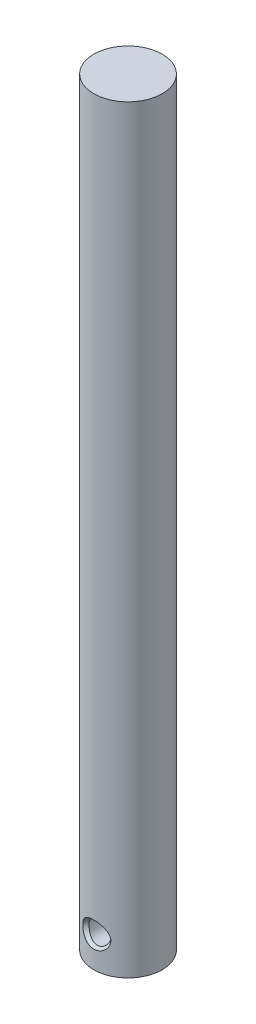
ISO-10303-21;
HEADER;
FILE_DESCRIPTION(('STEP AP214'),'2;1');
FILE_NAME('part.step','',(''),(''),'','','');
FILE_SCHEMA(('AUTOMOTIVE_DESIGN { 1 0 10303 214 1 1 1 1 }'));
ENDSEC;
DATA;
#1=APPLICATION_CONTEXT('core data for automotive mechanical design processes');
#2=APPLICATION_PROTOCOL_DEFINITION('international standard','automotive_design',2000,#1);
#3=PRODUCT_CONTEXT('',#1,'mechanical');
#4=PRODUCT('Part','Part','',(#3));
#5=PRODUCT_RELATED_PRODUCT_CATEGORY('part','',(#4));
#6=PRODUCT_DEFINITION_FORMATION('','',#4);
#7=PRODUCT_DEFINITION_CONTEXT('part definition',#1,'design');
#8=PRODUCT_DEFINITION('design','',#6,#7);
#9=PRODUCT_DEFINITION_SHAPE('','',#8);
#10=(LENGTH_UNIT() NAMED_UNIT(*) SI_UNIT(.MILLI.,.METRE.));
#11=(NAMED_UNIT(*) PLANE_ANGLE_UNIT() SI_UNIT($,.RADIAN.));
#12=(NAMED_UNIT(*) SI_UNIT($,.STERADIAN.) SOLID_ANGLE_UNIT());
#13=UNCERTAINTY_MEASURE_WITH_UNIT(LENGTH_MEASURE(1.E-05),#10,'distance_accuracy_value','');
#14=(GEOMETRIC_REPRESENTATION_CONTEXT(3) GLOBAL_UNCERTAINTY_ASSIGNED_CONTEXT((#13)) GLOBAL_UNIT_ASSIGNED_CONTEXT((#10,
#11,#12)) REPRESENTATION_CONTEXT('',''));
#15=CARTESIAN_POINT('',(0.,0.,0.));
#16=DIRECTION('',(0.,0.,1.));
#17=DIRECTION('',(1.,0.,0.));
#18=AXIS2_PLACEMENT_3D('',#15,#16,#17);
#19=CARTESIAN_POINT('',(0.,8.89,-9.9695));
#20=DIRECTION('',(0.,0.,1.));
#21=DIRECTION('',(1.,0.,0.));
#22=AXIS2_PLACEMENT_3D('',#19,#20,#21);
#23=CYLINDRICAL_SURFACE('',#22,3.175);
#24=CARTESIAN_POINT('',(-2.95146527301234E-05,5.71500000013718,-8.96894935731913));
#25=CARTESIAN_POINT('',(0.163211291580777,5.7150023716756,-8.96886882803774));
#26=CARTESIAN_POINT('',(0.326469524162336,5.72763826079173,-8.96299502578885));
#27=CARTESIAN_POINT('',(0.648307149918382,5.77762585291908,-8.94001729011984));
#28=CARTESIAN_POINT('',(0.806885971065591,5.81498056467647,-8.92291198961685));
#29=CARTESIAN_POINT('',(1.11592859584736,5.91313670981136,-8.87865355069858));
#30=CARTESIAN_POINT('',(1.26635400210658,5.97403966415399,-8.8514569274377));
#31=CARTESIAN_POINT('',(1.48270643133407,6.08131360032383,-8.80502814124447));
#32=CARTESIAN_POINT('',(1.55331421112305,6.11975151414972,-8.78860183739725));
#33=CARTESIAN_POINT('',(1.69116501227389,6.20169056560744,-8.7542425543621));
#34=CARTESIAN_POINT('',(1.75840791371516,6.24519188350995,-8.73630952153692));
#35=CARTESIAN_POINT('',(1.89407246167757,6.34039549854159,-8.69796140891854));
#36=CARTESIAN_POINT('',(1.96221158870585,6.39246675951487,-8.67746088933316));
#37=CARTESIAN_POINT('',(2.06098301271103,6.47446560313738,-8.64614449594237));
#38=CARTESIAN_POINT('',(2.09333783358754,6.50245101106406,-8.63561005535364));
#39=CARTESIAN_POINT('',(2.15686941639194,6.55968524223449,-8.61440982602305));
#40=CARTESIAN_POINT('',(2.18804617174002,6.58893407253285,-8.60374403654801));
#41=CARTESIAN_POINT('',(2.24919839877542,6.64867001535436,-8.58236555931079));
#42=CARTESIAN_POINT('',(2.27917338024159,6.67915762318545,-8.57165285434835));
#43=CARTESIAN_POINT('',(2.33790005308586,6.74135468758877,-8.5504250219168));
#44=CARTESIAN_POINT('',(2.36665175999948,6.77306412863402,-8.53990989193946));
#45=CARTESIAN_POINT('',(2.42287639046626,6.83765294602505,-8.51905406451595));
#46=CARTESIAN_POINT('',(2.45034932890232,6.87053230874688,-8.50871336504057));
#47=CARTESIAN_POINT('',(2.50397200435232,6.93741530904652,-8.48824600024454));
#48=CARTESIAN_POINT('',(2.53012169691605,6.97141898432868,-8.47811934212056));
#49=CARTESIAN_POINT('',(2.61010668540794,7.07991577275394,-8.44669136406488));
#50=CARTESIAN_POINT('',(2.66150391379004,7.15635767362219,-8.42581732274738));
#51=CARTESIAN_POINT('',(2.75761215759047,7.31370561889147,-8.3855528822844));
#52=CARTESIAN_POINT('',(2.80232233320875,7.3946122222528,-8.36616266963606));
#53=CARTESIAN_POINT('',(2.88464678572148,7.56034224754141,-8.32933738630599));
#54=CARTESIAN_POINT('',(2.9222649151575,7.64516351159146,-8.31190125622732));
#55=CARTESIAN_POINT('',(2.99006471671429,7.8181884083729,-8.27951203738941));
#56=CARTESIAN_POINT('',(3.02024512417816,7.9063926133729,-8.26455937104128));
#57=CARTESIAN_POINT('',(3.08880657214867,8.14006030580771,-8.2295853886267));
#58=CARTESIAN_POINT('',(3.12103444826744,8.2877621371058,-8.21200176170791));
#59=CARTESIAN_POINT('',(3.1641122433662,8.58701346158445,-8.18753389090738));
#60=CARTESIAN_POINT('',(3.17499251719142,8.73855718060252,-8.18063445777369));
#61=CARTESIAN_POINT('',(3.17500389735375,8.9688776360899,-8.18029878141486));
#62=CARTESIAN_POINT('',(3.17205827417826,9.04772789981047,-8.18199559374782));
#63=CARTESIAN_POINT('',(3.16033193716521,9.20485459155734,-8.18870919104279));
#64=CARTESIAN_POINT('',(3.15155051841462,9.28313094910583,-8.19372637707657));
#65=CARTESIAN_POINT('',(3.11655562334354,9.51642822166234,-8.21315951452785));
#66=CARTESIAN_POINT('',(3.08169159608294,9.6698658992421,-8.23195663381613));
#67=CARTESIAN_POINT('',(2.98958396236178,9.97081106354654,-8.27840617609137));
#68=CARTESIAN_POINT('',(2.93202886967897,10.1182030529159,-8.30618083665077));
#69=CARTESIAN_POINT('',(2.83035016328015,10.3308090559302,-8.35226047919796));
#70=CARTESIAN_POINT('',(2.79388782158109,10.4002814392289,-8.36836151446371));
#71=CARTESIAN_POINT('',(2.71605717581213,10.5361415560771,-8.40176465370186));
#72=CARTESIAN_POINT('',(2.67468863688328,10.6025291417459,-8.41906681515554));
#73=CARTESIAN_POINT('',(2.58231713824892,10.7392780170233,-8.45665905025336));
#74=CARTESIAN_POINT('',(2.53075346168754,10.8092284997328,-8.47706479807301));
#75=CARTESIAN_POINT('',(2.42220408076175,10.9445243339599,-8.51876886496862));
#76=CARTESIAN_POINT('',(2.36521793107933,11.0098693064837,-8.54006725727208));
#77=CARTESIAN_POINT('',(2.2759857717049,11.1041344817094,-8.57266320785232));
#78=CARTESIAN_POINT('',(2.24559922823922,11.1349460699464,-8.58364254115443));
#79=CARTESIAN_POINT('',(2.18358195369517,11.1953126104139,-8.60554155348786));
#80=CARTESIAN_POINT('',(2.15195122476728,11.2248675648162,-8.61646123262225));
#81=CARTESIAN_POINT('',(2.05524377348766,11.3115894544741,-8.64899363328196));
#82=CARTESIAN_POINT('',(1.98834048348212,11.3668253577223,-8.67038394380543));
#83=CARTESIAN_POINT('',(1.84601597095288,11.4748182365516,-8.71324011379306));
#84=CARTESIAN_POINT('',(1.77032592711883,11.5272474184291,-8.73463888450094));
#85=CARTESIAN_POINT('',(1.61429510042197,11.6255396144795,-8.77554837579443));
#86=CARTESIAN_POINT('',(1.53395394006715,11.6714020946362,-8.79505894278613));
#87=CARTESIAN_POINT('',(1.36920804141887,11.7560885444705,-8.83158692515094));
#88=CARTESIAN_POINT('',(1.28480765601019,11.7949198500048,-8.84860693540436));
#89=CARTESIAN_POINT('',(1.11245833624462,11.8651835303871,-8.87966227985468));
#90=CARTESIAN_POINT('',(1.02451008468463,11.896617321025,-8.89369818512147));
#91=CARTESIAN_POINT('',(0.859964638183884,11.9473314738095,-8.91642113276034));
#92=CARTESIAN_POINT('',(0.783784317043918,11.9677493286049,-8.92560371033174));
#93=CARTESIAN_POINT('',(0.629863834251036,12.0028967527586,-8.94140570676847));
#94=CARTESIAN_POINT('',(0.552123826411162,12.0176268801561,-8.94802537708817));
#95=CARTESIAN_POINT('',(0.395588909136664,12.0412536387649,-8.95860575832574));
#96=CARTESIAN_POINT('',(0.316794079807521,12.0501507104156,-8.96256667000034));
#97=CARTESIAN_POINT('',(0.158666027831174,12.0620240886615,-8.96777881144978));
#98=CARTESIAN_POINT('',(0.0793327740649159,12.0650000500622,-8.96902988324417));
#99=CARTESIAN_POINT('',(-0.0818836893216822,12.064999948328,-8.96886624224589));
#100=CARTESIAN_POINT('',(-0.16376686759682,12.0618294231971,-8.96736451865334));
#101=CARTESIAN_POINT('',(-0.326944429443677,12.0491817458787,-8.96156119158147));
#102=CARTESIAN_POINT('',(-0.408238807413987,12.0397045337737,-8.95725956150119));
#103=CARTESIAN_POINT('',(-0.569662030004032,12.0145452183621,-8.94587038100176));
#104=CARTESIAN_POINT('',(-0.649790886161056,11.9988631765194,-8.93878285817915));
#105=CARTESIAN_POINT('',(-0.808338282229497,11.9614571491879,-8.92192366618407));
#106=CARTESIAN_POINT('',(-0.886756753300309,11.9397329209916,-8.91215188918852));
#107=CARTESIAN_POINT('',(-1.04162950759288,11.8903767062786,-8.89006864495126));
#108=CARTESIAN_POINT('',(-1.11807651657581,11.8627256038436,-8.87774896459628));
#109=CARTESIAN_POINT('',(-1.26828670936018,11.8018109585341,-8.85085362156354));
#110=CARTESIAN_POINT('',(-1.3420498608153,11.768547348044,-8.8362779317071));
#111=CARTESIAN_POINT('',(-1.48652712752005,11.696666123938,-8.80519449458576));
#112=CARTESIAN_POINT('',(-1.55724012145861,11.6580465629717,-8.78868604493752));
#113=CARTESIAN_POINT('',(-1.69525117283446,11.5757411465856,-8.75412073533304));
#114=CARTESIAN_POINT('',(-1.76254911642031,11.5320551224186,-8.73606382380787));
#115=CARTESIAN_POINT('',(-1.89804775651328,11.4366404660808,-8.69749677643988));
#116=CARTESIAN_POINT('',(-1.96597972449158,11.3845624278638,-8.6769034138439));
#117=CARTESIAN_POINT('',(-2.06444300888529,11.3025765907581,-8.6454364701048));
#118=CARTESIAN_POINT('',(-2.09669552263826,11.2745993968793,-8.63484996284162));
#119=CARTESIAN_POINT('',(-2.16002434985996,11.2173891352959,-8.6135413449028));
#120=CARTESIAN_POINT('',(-2.19110065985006,11.1881560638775,-8.60281923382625));
#121=CARTESIAN_POINT('',(-2.25205662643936,11.1284564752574,-8.58133608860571));
#122=CARTESIAN_POINT('',(-2.28193578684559,11.0979894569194,-8.57057504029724));
#123=CARTESIAN_POINT('',(-2.34047509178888,11.035838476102,-8.54925507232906));
#124=CARTESIAN_POINT('',(-2.36913525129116,11.0041545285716,-8.5386961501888));
#125=CARTESIAN_POINT('',(-2.42518108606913,10.9396215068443,-8.51775644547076));
#126=CARTESIAN_POINT('',(-2.45256677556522,10.906772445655,-8.50737566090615));
#127=CARTESIAN_POINT('',(-2.50601966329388,10.8399542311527,-8.48683328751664));
#128=CARTESIAN_POINT('',(-2.53208681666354,10.8059850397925,-8.4766717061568));
#129=CARTESIAN_POINT('',(-2.61193764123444,10.6974428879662,-8.44509694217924));
#130=CARTESIAN_POINT('',(-2.66327863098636,10.6209170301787,-8.42412404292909));
#131=CARTESIAN_POINT('',(-2.75926889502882,10.4633950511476,-8.38370381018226));
#132=CARTESIAN_POINT('',(-2.80391730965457,10.3823983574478,-8.36425667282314));
#133=CARTESIAN_POINT('',(-2.88610875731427,10.2164849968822,-8.32736891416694));
#134=CARTESIAN_POINT('',(-2.92365590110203,10.1315706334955,-8.30992713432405));
#135=CARTESIAN_POINT('',(-2.99130317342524,9.95835558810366,-8.27758494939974));
#136=CARTESIAN_POINT('',(-3.02140206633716,9.87005434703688,-8.26268496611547));
#137=CARTESIAN_POINT('',(-3.08952699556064,9.63684052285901,-8.22803522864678));
#138=CARTESIAN_POINT('',(-3.12148750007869,9.4897254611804,-8.21073323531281));
#139=CARTESIAN_POINT('',(-3.16420538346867,9.1916984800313,-8.18688688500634));
#140=CARTESIAN_POINT('',(-3.17499249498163,9.04079218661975,-8.18032744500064));
#141=CARTESIAN_POINT('',(-3.1750039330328,8.81097678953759,-8.18046002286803));
#142=CARTESIAN_POINT('',(-3.17204743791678,8.73198491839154,-8.18233093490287));
#143=CARTESIAN_POINT('',(-3.16027931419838,8.57458303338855,-8.18937620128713));
#144=CARTESIAN_POINT('',(-3.15146693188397,8.49617309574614,-8.19455098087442));
#145=CARTESIAN_POINT('',(-3.11635014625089,8.26248113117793,-8.21442513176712));
#146=CARTESIAN_POINT('',(-3.08136620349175,8.10879406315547,-8.23347372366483));
#147=CARTESIAN_POINT('',(-2.98892485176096,7.80731956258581,-8.28029289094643));
#148=CARTESIAN_POINT('',(-2.93114771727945,7.65965057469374,-8.308186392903));
#149=CARTESIAN_POINT('',(-2.82906327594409,7.4466562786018,-8.35433138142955));
#150=CARTESIAN_POINT('',(-2.79245393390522,7.37705956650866,-8.37043519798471));
#151=CARTESIAN_POINT('',(-2.71430482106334,7.24096193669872,-8.40380878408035));
#152=CARTESIAN_POINT('',(-2.67276481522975,7.17446116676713,-8.42107860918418));
#153=CARTESIAN_POINT('',(-2.58002330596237,7.03751463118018,-8.45856149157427));
#154=CARTESIAN_POINT('',(-2.52826031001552,6.96747984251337,-8.47888595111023));
#155=CARTESIAN_POINT('',(-2.41928944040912,6.83203633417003,-8.52040166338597));
#156=CARTESIAN_POINT('',(-2.36208112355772,6.76662799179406,-8.54159298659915));
#157=CARTESIAN_POINT('',(-2.27250004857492,6.67228613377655,-8.5740084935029));
#158=CARTESIAN_POINT('',(-2.24199469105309,6.64145219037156,-8.58492427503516));
#159=CARTESIAN_POINT('',(-2.17973556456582,6.58104832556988,-8.60669262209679));
#160=CARTESIAN_POINT('',(-2.14798179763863,6.5514784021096,-8.61754518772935));
#161=CARTESIAN_POINT('',(-2.05090349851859,6.46472645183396,-8.64988996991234));
#162=CARTESIAN_POINT('',(-1.98375052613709,6.40949019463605,-8.67117350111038));
#163=CARTESIAN_POINT('',(-1.84108829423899,6.30167057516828,-8.7137836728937));
#164=CARTESIAN_POINT('',(-1.76532235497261,6.24940224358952,-8.73504776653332));
#165=CARTESIAN_POINT('',(-1.60916724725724,6.151441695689,-8.77572926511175));
#166=CARTESIAN_POINT('',(-1.52877770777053,6.10575000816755,-8.79514652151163));
#167=CARTESIAN_POINT('',(-1.3639501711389,6.02140774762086,-8.83152959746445));
#168=CARTESIAN_POINT('',(-1.27951638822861,5.9827500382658,-8.84849789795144));
#169=CARTESIAN_POINT('',(-1.10715391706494,5.91283793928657,-8.87948959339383));
#170=CARTESIAN_POINT('',(-1.0192259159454,5.88158210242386,-8.89351356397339));
#171=CARTESIAN_POINT('',(-0.780352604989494,5.80843266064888,-8.92649345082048));
#172=CARTESIAN_POINT('',(-0.62676662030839,5.77350515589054,-8.94243061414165));
#173=CARTESIAN_POINT('',(-0.315468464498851,5.72678999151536,-8.96369641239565));
#174=CARTESIAN_POINT('',(-0.157757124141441,5.71499770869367,-8.96902716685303));
#175=CARTESIAN_POINT('',(-2.95146527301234E-05,5.71500000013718,-8.96894935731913));
#176=B_SPLINE_CURVE_WITH_KNOTS('',3,(#24,#25,#26,#27,#28,#29,#30,#31,#32,#33,#34,#35,#36,#37,
#38,#39,#40,#41,#42,#43,#44,#45,#46,#47,#48,#49,#50,#51,#52,#53,#54,#55,#56,#57,#58,#59,#60,#61,
#62,#63,#64,#65,#66,#67,#68,#69,#70,#71,#72,#73,#74,#75,#76,#77,#78,#79,#80,#81,#82,#83,#84,#85,
#86,#87,#88,#89,#90,#91,#92,#93,#94,#95,#96,#97,#98,#99,#100,#101,#102,#103,#104,#105,#106,#107,
#108,#109,#110,#111,#112,#113,#114,#115,#116,#117,#118,#119,#120,#121,#122,#123,#124,#125,#126,
#127,#128,#129,#130,#131,#132,#133,#134,#135,#136,#137,#138,#139,#140,#141,#142,#143,#144,#145,
#146,#147,#148,#149,#150,#151,#152,#153,#154,#155,#156,#157,#158,#159,#160,#161,#162,#163,#164,
#165,#166,#167,#168,#169,#170,#171,#172,#173,#174,#175),.UNSPECIFIED.,.T.,.F.,(4,2,2,2,2,2,2,2,
2,2,2,2,2,2,2,2,2,2,2,2,2,2,2,2,2,2,2,2,2,2,2,2,2,2,2,2,2,2,2,2,2,2,2,2,2,2,2,2,2,2,2,2,2,2,2,2,
2,2,2,2,2,2,2,2,2,2,2,2,2,2,2,2,2,2,2,4),(0.,0.489169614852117,0.97839878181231,
1.46976105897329,1.71572516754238,1.9616980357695,2.2259155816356,2.35805792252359,
2.49020100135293,2.62239744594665,2.75459221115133,2.88678543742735,3.01898310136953,
3.30195030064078,3.58495300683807,3.86780153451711,4.15069812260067,4.60542239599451,
5.05949961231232,5.29600165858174,5.53253227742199,6.00574586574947,6.48569515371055,
6.72579777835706,6.9659119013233,7.23342130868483,7.5009527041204,7.63485958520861,
7.76876623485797,8.03652874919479,8.31976725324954,8.60302877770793,8.8859930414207,
9.16890310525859,9.40685990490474,9.64479335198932,9.88270883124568,10.1206381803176,
10.3662180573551,10.6118002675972,10.8573800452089,11.102969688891,11.3493636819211,
11.5957606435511,11.8422474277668,12.088742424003,12.3525544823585,12.4844939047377,
12.6164337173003,12.7484276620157,12.8804199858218,13.0124108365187,13.1444061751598,
13.4275502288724,13.7107306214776,13.9937465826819,14.2768094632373,14.7295716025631,
15.1816974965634,15.4186357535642,15.655604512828,16.1297111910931,16.6107192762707,
16.851347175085,17.0919865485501,17.3599827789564,17.6280008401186,17.7621499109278,
17.8962987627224,18.164545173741,18.447607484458,18.7306925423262,19.0134887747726,
19.2962296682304,19.7689728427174,20.2416215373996),.UNSPECIFIED.);
#177=CARTESIAN_POINT('',(0.,12.065,-8.96894935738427));
#178=VERTEX_POINT('',#177);
#179=EDGE_CURVE('E57',#178,#178,#176,.T.);
#180=ORIENTED_EDGE('',*,*,#179,.F.);
#181=EDGE_LOOP('',(#180));
#182=FACE_BOUND('',#181,.T.);
#183=CARTESIAN_POINT('',(3.175,8.89,8.18041296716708));
#184=CARTESIAN_POINT('',(3.17500204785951,8.81117598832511,8.18029953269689));
#185=CARTESIAN_POINT('',(3.17206133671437,8.73236949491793,8.18199978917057));
#186=CARTESIAN_POINT('',(3.16034975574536,8.57532789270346,8.18872446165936));
#187=CARTESIAN_POINT('',(3.15157763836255,8.4970929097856,8.19374958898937));
#188=CARTESIAN_POINT('',(3.11661423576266,8.26387676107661,8.21321157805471));
#189=CARTESIAN_POINT('',(3.08177605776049,8.11047741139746,8.23203429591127));
#190=CARTESIAN_POINT('',(2.98973310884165,7.80960804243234,8.27852304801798));
#191=CARTESIAN_POINT('',(2.93221760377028,7.66225322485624,8.30631092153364));
#192=CARTESIAN_POINT('',(2.83060595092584,7.4496950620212,8.35238674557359));
#193=CARTESIAN_POINT('',(2.79416834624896,7.38023893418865,8.36848210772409));
#194=CARTESIAN_POINT('',(2.71638877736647,7.24440685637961,8.40186459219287));
#195=CARTESIAN_POINT('',(2.67504658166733,7.17803105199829,8.41915177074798));
#196=CARTESIAN_POINT('',(2.58269998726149,7.04125526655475,8.45671370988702));
#197=CARTESIAN_POINT('',(2.53113121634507,6.97126819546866,8.47710360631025));
#198=CARTESIAN_POINT('',(2.42256450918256,6.83589923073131,8.51876406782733));
#199=CARTESIAN_POINT('',(2.3655661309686,6.77051771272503,8.54003470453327));
#200=CARTESIAN_POINT('',(2.27631157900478,6.67620017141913,8.57257691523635));
#201=CARTESIAN_POINT('',(2.24591800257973,6.64537252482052,8.58353591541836));
#202=CARTESIAN_POINT('',(2.18388534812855,6.58497449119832,8.60539306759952));
#203=CARTESIAN_POINT('',(2.15224627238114,6.55540410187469,8.61629121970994));
#204=CARTESIAN_POINT('',(2.05551243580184,6.46863739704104,8.64876152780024));
#205=CARTESIAN_POINT('',(1.9885900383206,6.41337389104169,8.67011364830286));
#206=CARTESIAN_POINT('',(1.84626629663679,6.30536128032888,8.71288446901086));
#207=CARTESIAN_POINT('',(1.77059892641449,6.25293670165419,8.73423714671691));
#208=CARTESIAN_POINT('',(1.61461993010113,6.15465291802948,8.77506658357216));
#209=CARTESIAN_POINT('',(1.53430803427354,6.10879409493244,8.79454323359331));
#210=CARTESIAN_POINT('',(1.36959362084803,6.0240955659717,8.83102769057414));
#211=CARTESIAN_POINT('',(1.28519389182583,5.98525115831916,8.84803714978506));
#212=CARTESIAN_POINT('',(1.11284318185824,5.91495988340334,8.87909237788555));
#213=CARTESIAN_POINT('',(1.02489254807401,5.88351229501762,8.89313843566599));
#214=CARTESIAN_POINT('',(0.851246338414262,5.82997045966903,8.91715704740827));
#215=CARTESIAN_POINT('',(0.765709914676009,5.80744381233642,8.92731676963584));
#216=CARTESIAN_POINT('',(0.592747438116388,5.76956548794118,8.94441324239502));
#217=CARTESIAN_POINT('',(0.505321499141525,5.75421337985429,8.95135018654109));
#218=CARTESIAN_POINT('',(0.329305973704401,5.73087621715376,8.96187735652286));
#219=CARTESIAN_POINT('',(0.240716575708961,5.72288998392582,8.96546811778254));
#220=CARTESIAN_POINT('',(0.0631091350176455,5.71438268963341,8.96925218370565));
#221=CARTESIAN_POINT('',(-0.0259088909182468,5.71386133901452,8.96944562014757));
#222=CARTESIAN_POINT('',(-0.196787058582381,5.72004120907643,8.96663396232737));
#223=CARTESIAN_POINT('',(-0.278671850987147,5.72619078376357,8.96387338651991));
#224=CARTESIAN_POINT('',(-0.441576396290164,5.74478849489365,8.95551686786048));
#225=CARTESIAN_POINT('',(-0.52259616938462,5.75723648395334,8.94992099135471));
#226=CARTESIAN_POINT('',(-0.683191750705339,5.78829677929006,8.93595243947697));
#227=CARTESIAN_POINT('',(-0.762767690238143,5.80690852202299,8.92758001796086));
#228=CARTESIAN_POINT('',(-0.919919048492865,5.85009667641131,8.90819946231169));
#229=CARTESIAN_POINT('',(-0.997495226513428,5.87467078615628,8.89719234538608));
#230=CARTESIAN_POINT('',(-1.15052473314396,5.92966938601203,8.87271247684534));
#231=CARTESIAN_POINT('',(-1.2259675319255,5.96011851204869,8.85922935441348));
#232=CARTESIAN_POINT('',(-1.37395454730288,6.02653140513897,8.8301329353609));
#233=CARTESIAN_POINT('',(-1.44649875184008,6.0624951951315,8.81451962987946));
#234=CARTESIAN_POINT('',(-1.58835671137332,6.13967795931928,8.78151802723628));
#235=CARTESIAN_POINT('',(-1.65766891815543,6.18089941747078,8.76412889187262));
#236=CARTESIAN_POINT('',(-1.79271078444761,6.26830515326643,8.72798464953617));
#237=CARTESIAN_POINT('',(-1.85844029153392,6.31448964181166,8.70922948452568));
#238=CARTESIAN_POINT('',(-1.99109373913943,6.4153987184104,8.66926371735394));
#239=CARTESIAN_POINT('',(-2.05770178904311,6.47050974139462,8.64797618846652));
#240=CARTESIAN_POINT('',(-2.15399474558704,6.55702020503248,8.61563658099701));
#241=CARTESIAN_POINT('',(-2.18549294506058,6.5865016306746,8.60478726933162));
#242=CARTESIAN_POINT('',(-2.24725572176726,6.64671497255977,8.5830470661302));
#243=CARTESIAN_POINT('',(-2.27752030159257,6.67744688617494,8.57215617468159));
#244=CARTESIAN_POINT('',(-2.36647219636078,6.77153796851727,8.53977584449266));
#245=CARTESIAN_POINT('',(-2.42330130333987,6.83677778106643,8.51858444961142));
#246=CARTESIAN_POINT('',(-2.53155765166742,6.97184050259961,8.47706989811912));
#247=CARTESIAN_POINT('',(-2.58298489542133,7.04166340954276,8.45674674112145));
#248=CARTESIAN_POINT('',(-2.68305998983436,7.18991454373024,8.41606653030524));
#249=CARTESIAN_POINT('',(-2.73134631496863,7.26860789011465,8.39578319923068));
#250=CARTESIAN_POINT('',(-2.82104211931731,7.43024253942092,8.35694175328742));
#251=CARTESIAN_POINT('',(-2.86245064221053,7.51318443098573,8.33838387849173));
#252=CARTESIAN_POINT('',(-2.93795726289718,7.68267777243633,8.30352011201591));
#253=CARTESIAN_POINT('',(-2.9720637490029,7.76922494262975,8.28721164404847));
#254=CARTESIAN_POINT('',(-3.03266588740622,7.94541262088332,8.25739376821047));
#255=CARTESIAN_POINT('',(-3.0591611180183,8.03505330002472,8.24388451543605));
#256=CARTESIAN_POINT('',(-3.1124917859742,8.25016422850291,8.21595642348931));
#257=CARTESIAN_POINT('',(-3.13588101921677,8.37670648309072,8.20302446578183));
#258=CARTESIAN_POINT('',(-3.16712567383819,8.63218608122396,8.18526255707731));
#259=CARTESIAN_POINT('',(-3.17499645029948,8.76112092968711,8.18042459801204));
#260=CARTESIAN_POINT('',(-3.1750021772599,8.96904989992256,8.18040573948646));
#261=CARTESIAN_POINT('',(-3.17204457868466,9.04807879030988,8.18221428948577));
#262=CARTESIAN_POINT('',(-3.1602667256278,9.20555983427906,8.18911657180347));
#263=CARTESIAN_POINT('',(-3.15144523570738,9.28401186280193,8.19421099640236));
#264=CARTESIAN_POINT('',(-3.1162859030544,9.51786517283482,8.21386270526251));
#265=CARTESIAN_POINT('',(-3.08125335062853,9.6716738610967,8.23278760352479));
#266=CARTESIAN_POINT('',(-2.98871678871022,9.97325722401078,8.2794725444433));
#267=CARTESIAN_POINT('',(-2.93090815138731,10.1209187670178,8.30735136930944));
#268=CARTESIAN_POINT('',(-2.82878986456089,10.3338791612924,8.35356912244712));
#269=CARTESIAN_POINT('',(-2.79217201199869,10.4034599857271,8.36971279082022));
#270=CARTESIAN_POINT('',(-2.7140112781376,10.5395205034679,8.40319096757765));
#271=CARTESIAN_POINT('',(-2.67246816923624,10.6060000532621,8.42052553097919));
#272=CARTESIAN_POINT('',(-2.5797782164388,10.7428213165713,8.45813987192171));
#273=CARTESIAN_POINT('',(-2.52807673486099,10.8127562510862,8.47853160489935));
#274=CARTESIAN_POINT('',(-2.41924436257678,10.9480117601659,8.52017764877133));
#275=CARTESIAN_POINT('',(-2.36211303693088,11.0133319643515,8.54143202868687));
#276=CARTESIAN_POINT('',(-2.27265534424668,11.1075535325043,8.5739160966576));
#277=CARTESIAN_POINT('',(-2.24219355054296,11.1383483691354,8.58485001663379));
#278=CARTESIAN_POINT('',(-2.18002462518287,11.1986776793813,8.60665416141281));
#279=CARTESIAN_POINT('',(-2.14831749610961,11.2282121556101,8.61752438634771));
#280=CARTESIAN_POINT('',(-2.05138185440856,11.3148648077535,8.64991622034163));
#281=CARTESIAN_POINT('',(-1.98432804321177,11.3700438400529,8.67122308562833));
#282=CARTESIAN_POINT('',(-1.84177620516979,11.4778403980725,8.71390124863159));
#283=CARTESIAN_POINT('',(-1.76601496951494,11.5301353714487,8.73520772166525));
#284=CARTESIAN_POINT('',(-1.60986266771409,11.6281496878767,8.77595757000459));
#285=CARTESIAN_POINT('',(-1.52947133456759,11.6738686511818,8.79540083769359));
#286=CARTESIAN_POINT('',(-1.36461092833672,11.7582803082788,8.83182663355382));
#287=CARTESIAN_POINT('',(-1.28014456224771,11.7969775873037,8.848810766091));
#288=CARTESIAN_POINT('',(-1.10767437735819,11.8669684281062,8.87981536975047));
#289=CARTESIAN_POINT('',(-1.01967090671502,11.8982627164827,8.89383613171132));
#290=CARTESIAN_POINT('',(-0.845919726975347,11.9515066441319,8.91779762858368));
#291=CARTESIAN_POINT('',(-0.760330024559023,11.9738877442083,8.9279255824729));
#292=CARTESIAN_POINT('',(-0.587274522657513,12.011469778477,8.94493958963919));
#293=CARTESIAN_POINT('',(-0.49980884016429,12.0266711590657,8.95182584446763));
#294=CARTESIAN_POINT('',(-0.323724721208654,12.0497002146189,8.96222216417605));
#295=CARTESIAN_POINT('',(-0.235106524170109,12.057529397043,8.96573291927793));
#296=CARTESIAN_POINT('',(-0.0574822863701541,12.0657262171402,8.96933127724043));
#297=CARTESIAN_POINT('',(0.0315237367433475,12.0660941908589,8.96941903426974));
#298=CARTESIAN_POINT('',(0.284096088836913,12.056494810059,8.96486170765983));
#299=CARTESIAN_POINT('',(0.447348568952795,12.0375654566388,8.95616990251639));
#300=CARTESIAN_POINT('',(0.767977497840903,11.9750489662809,8.92762797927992));
#301=CARTESIAN_POINT('',(0.925355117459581,11.9314667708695,8.90778009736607));
#302=CARTESIAN_POINT('',(1.15435499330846,11.8488438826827,8.87082666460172));
#303=CARTESIAN_POINT('',(1.22974549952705,11.8182994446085,8.85725560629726));
#304=CARTESIAN_POINT('',(1.37764865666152,11.7516915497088,8.82803435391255));
#305=CARTESIAN_POINT('',(1.45016129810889,11.7156280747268,8.81238415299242));
#306=CARTESIAN_POINT('',(1.5919500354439,11.6382447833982,8.77936336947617));
#307=CARTESIAN_POINT('',(1.66122467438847,11.5969226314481,8.76199202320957));
#308=CARTESIAN_POINT('',(1.79619535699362,11.5093093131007,8.7259375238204));
#309=CARTESIAN_POINT('',(1.86189123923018,11.4630179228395,8.70725431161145));
#310=CARTESIAN_POINT('',(1.99461980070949,11.3617679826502,8.6674474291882));
#311=CARTESIAN_POINT('',(2.06132719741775,11.3064107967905,8.64624882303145));
#312=CARTESIAN_POINT('',(2.15775044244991,11.219508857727,8.61407671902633));
#313=CARTESIAN_POINT('',(2.18928896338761,11.1898932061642,8.60328893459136));
#314=CARTESIAN_POINT('',(2.25112574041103,11.1294037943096,8.5816856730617));
#315=CARTESIAN_POINT('',(2.28142399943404,11.0985300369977,8.57087019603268));
#316=CARTESIAN_POINT('',(2.37045903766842,11.0040101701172,8.53869369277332));
#317=CARTESIAN_POINT('',(2.42731901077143,10.9384808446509,8.51760847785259));
#318=CARTESIAN_POINT('',(2.53559194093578,10.8028339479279,8.47627156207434));
#319=CARTESIAN_POINT('',(2.58700490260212,10.7327163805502,8.45601986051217));
#320=CARTESIAN_POINT('',(2.68685605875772,10.5840781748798,8.41551967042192));
#321=CARTESIAN_POINT('',(2.73494874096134,10.5053060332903,8.39533950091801));
#322=CARTESIAN_POINT('',(2.82424988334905,10.3435391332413,8.35667448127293));
#323=CARTESIAN_POINT('',(2.86545739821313,10.2605437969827,8.33818986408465));
#324=CARTESIAN_POINT('',(2.94055833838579,10.0909696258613,8.3034472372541));
#325=CARTESIAN_POINT('',(2.9744602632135,10.0043950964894,8.28718664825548));
#326=CARTESIAN_POINT('',(3.03465369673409,9.82817631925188,8.25744060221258));
#327=CARTESIAN_POINT('',(3.06094483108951,9.73853192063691,8.24395528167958));
#328=CARTESIAN_POINT('',(3.11355543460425,9.52442165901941,8.21619032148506));
#329=CARTESIAN_POINT('',(3.13654694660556,9.39892986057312,8.20333981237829));
#330=CARTESIAN_POINT('',(3.16725994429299,9.14560838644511,8.18554702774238));
#331=CARTESIAN_POINT('',(3.17499668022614,9.01778117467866,8.18059685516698));
#332=CARTESIAN_POINT('',(3.175,8.89,8.18041296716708));
#333=B_SPLINE_CURVE_WITH_KNOTS('',3,(#183,#184,#185,#186,#187,#188,#189,#190,#191,#192,#193,
#194,#195,#196,#197,#198,#199,#200,#201,#202,#203,#204,#205,#206,#207,#208,#209,#210,#211,#212,
#213,#214,#215,#216,#217,#218,#219,#220,#221,#222,#223,#224,#225,#226,#227,#228,#229,#230,#231,
#232,#233,#234,#235,#236,#237,#238,#239,#240,#241,#242,#243,#244,#245,#246,#247,#248,#249,#250,
#251,#252,#253,#254,#255,#256,#257,#258,#259,#260,#261,#262,#263,#264,#265,#266,#267,#268,#269,
#270,#271,#272,#273,#274,#275,#276,#277,#278,#279,#280,#281,#282,#283,#284,#285,#286,#287,#288,
#289,#290,#291,#292,#293,#294,#295,#296,#297,#298,#299,#300,#301,#302,#303,#304,#305,#306,#307,
#308,#309,#310,#311,#312,#313,#314,#315,#316,#317,#318,#319,#320,#321,#322,#323,#324,#325,#326,
#327,#328,#329,#330,#331,#332),.UNSPECIFIED.,.T.,.F.,(4,2,2,2,2,2,2,2,2,2,2,2,2,2,2,2,2,2,2,2,2,
2,2,2,2,2,2,2,2,2,2,2,2,2,2,2,2,2,2,2,2,2,2,2,2,2,2,2,2,2,2,2,2,2,2,2,2,2,2,2,2,2,2,2,2,2,2,2,2,
2,2,2,2,2,4),(0.,0.236358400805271,0.472767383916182,0.945860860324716,1.42567565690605,
1.66569902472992,1.90573372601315,2.17332689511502,2.44094186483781,2.57488133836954,
2.70882056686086,2.97664947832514,3.2597948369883,3.54295665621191,3.82592796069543,
4.10887166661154,4.37561718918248,4.64234668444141,4.90903349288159,5.17570995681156,
5.42190463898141,5.66809356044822,5.91425997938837,6.16033151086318,6.40745825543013,
6.65458602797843,6.90183099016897,7.14908646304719,7.41587600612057,7.54930434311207,
7.68273239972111,7.94965648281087,8.21658044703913,8.49980509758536,8.78306909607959,
9.06600592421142,9.34895842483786,9.73579067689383,10.1222399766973,10.3592742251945,
10.596358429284,11.0707928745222,11.5518008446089,11.792422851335,12.0330559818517,
12.3007579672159,12.568481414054,12.7024739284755,12.8364661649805,13.1044011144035,
13.3875255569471,13.6706663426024,13.9536215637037,14.2365490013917,14.5033255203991,
14.7700854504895,15.0367908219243,15.3034841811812,15.7947034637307,16.2858243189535,
16.5330077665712,16.7801920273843,17.0274864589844,17.2747920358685,17.5421965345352,
17.675932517,17.8096681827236,18.0772104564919,18.3447525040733,18.6278126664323,
18.9109116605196,19.1936794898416,19.4764612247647,19.8600041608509,20.2431634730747),.UNSPECIFIED.);
#334=CARTESIAN_POINT('',(3.175,8.89,8.18041296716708));
#335=VERTEX_POINT('',#334);
#336=EDGE_CURVE('E21',#335,#335,#333,.T.);
#337=ORIENTED_EDGE('',*,*,#336,.F.);
#338=EDGE_LOOP('',(#337));
#339=FACE_BOUND('',#338,.T.);
#340=ADVANCED_FACE('F14',(#182,#339),#23,.F.);
#341=CARTESIAN_POINT('',(0.,220.98,0.));
#342=DIRECTION('',(0.,1.,0.));
#343=DIRECTION('',(0.,0.,1.));
#344=AXIS2_PLACEMENT_3D('',#341,#342,#343);
#345=PLANE('',#344);
#346=CARTESIAN_POINT('',(0.,220.98,0.));
#347=DIRECTION('',(0.,-1.,0.));
#348=DIRECTION('',(0.,0.,-1.));
#349=AXIS2_PLACEMENT_3D('',#346,#347,#348);
#350=CIRCLE('',#349,9.9695);
#351=CARTESIAN_POINT('',(0.,220.98,-9.9695));
#352=VERTEX_POINT('',#351);
#353=EDGE_CURVE('E55',#352,#352,#350,.T.);
#354=ORIENTED_EDGE('',*,*,#353,.F.);
#355=EDGE_LOOP('',(#354));
#356=FACE_BOUND('',#355,.T.);
#357=ADVANCED_FACE('F63',(#356),#345,.T.);
#358=CARTESIAN_POINT('',(4.09670958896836,8.89,9.10212255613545));
#359=CARTESIAN_POINT('',(4.09796480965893,7.91092817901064,9.10166697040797));
#360=CARTESIAN_POINT('',(3.64649225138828,6.96012679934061,9.32010380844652));
#361=CARTESIAN_POINT('',(2.15040513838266,5.61515751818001,9.7806936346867));
#362=CARTESIAN_POINT('',(1.09348763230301,5.20887558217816,9.97895779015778));
#363=CARTESIAN_POINT('',(-1.08527036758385,5.20638297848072,9.98005153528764));
#364=CARTESIAN_POINT('',(-2.14797852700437,5.61340294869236,9.78124196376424));
#365=CARTESIAN_POINT('',(-3.64544424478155,6.95875651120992,9.32060706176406));
#366=CARTESIAN_POINT('',(-4.09649626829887,7.9078487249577,9.10227100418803));
#367=CARTESIAN_POINT('',(-4.09692282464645,9.87109048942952,9.10197414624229));
#368=CARTESIAN_POINT('',(-3.64539739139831,10.8214653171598,9.32072577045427));
#369=CARTESIAN_POINT('',(-2.14654933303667,12.167701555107,9.78156976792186));
#370=CARTESIAN_POINT('',(-1.08831627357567,12.5719166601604,9.97930654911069));
#371=CARTESIAN_POINT('',(1.08913304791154,12.572828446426,9.97970444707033));
#372=CARTESIAN_POINT('',(2.15057711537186,12.1673056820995,9.7809804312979));
#373=CARTESIAN_POINT('',(3.64623743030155,10.8174845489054,9.3198420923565));
#374=CARTESIAN_POINT('',(4.0954543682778,9.86907182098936,9.10257814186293));
#375=CARTESIAN_POINT('',(4.09670958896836,8.89,9.10212255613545));
#376=CARTESIAN_POINT('',(4.08758375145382,8.89,9.09299671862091));
#377=CARTESIAN_POINT('',(4.08883617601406,7.91226382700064,9.09254158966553));
#378=CARTESIAN_POINT('',(3.63836931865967,6.96275953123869,9.31075942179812));
#379=CARTESIAN_POINT('',(2.1456148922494,5.61962505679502,9.77088745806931));
#380=CARTESIAN_POINT('',(1.09105181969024,5.21389737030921,9.96895283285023));
#381=CARTESIAN_POINT('',(-1.08285285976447,5.21140816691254,9.97004548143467));
#382=CARTESIAN_POINT('',(-2.14319368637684,5.61787288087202,9.77143523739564));
#383=CARTESIAN_POINT('',(-3.63732364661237,6.96139111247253,9.31126217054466));
#384=CARTESIAN_POINT('',(-4.0873709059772,7.90918857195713,9.09314501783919));
#385=CARTESIAN_POINT('',(-4.08779651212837,9.86975208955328,9.0928484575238));
#386=CARTESIAN_POINT('',(-3.63727689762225,10.8188304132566,9.31138076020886));
#387=CARTESIAN_POINT('',(-2.14176767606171,12.1632301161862,9.77176271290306));
#388=CARTESIAN_POINT('',(-1.08589198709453,12.566893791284,9.96930124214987));
#389=CARTESIAN_POINT('',(1.08670694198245,12.5678043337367,9.96969874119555));
#390=CARTESIAN_POINT('',(2.14578648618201,12.1628347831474,9.7711739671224));
#391=CARTESIAN_POINT('',(3.63811506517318,10.8148550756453,9.31049796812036));
#392=CARTESIAN_POINT('',(4.08633132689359,9.86773617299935,9.0934518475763));
#393=CARTESIAN_POINT('',(4.08758375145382,8.89,9.09299671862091));
#394=CARTESIAN_POINT('',(3.175,8.89,8.18041296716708));
#395=CARTESIAN_POINT('',(3.17597281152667,8.04582862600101,8.18000351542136));
#396=CARTESIAN_POINT('',(2.82607604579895,7.22603272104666,8.3763207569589));
#397=CARTESIAN_POINT('',(1.66659027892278,6.06637891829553,8.79026979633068));
#398=CARTESIAN_POINT('',(0.847470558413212,5.71607618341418,8.96845710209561));
#399=CARTESIAN_POINT('',(-0.841102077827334,5.7139270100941,8.96944009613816));
#400=CARTESIAN_POINT('',(-1.66470962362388,6.06486609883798,8.79076260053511));
#401=CARTESIAN_POINT('',(-2.82526382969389,7.22485123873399,8.37677304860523));
#402=CARTESIAN_POINT('',(-3.17483467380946,8.0431732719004,8.18054638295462));
#403=CARTESIAN_POINT('',(-3.17516526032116,9.73591210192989,8.18027958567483));
#404=CARTESIAN_POINT('',(-2.82522752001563,10.5553400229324,8.3768797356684));
#405=CARTESIAN_POINT('',(-1.66360197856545,11.7160862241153,8.7910572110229));
#406=CARTESIAN_POINT('',(-0.843463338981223,12.0646069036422,8.96877054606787));
#407=CARTESIAN_POINT('',(0.844096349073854,12.0653930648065,8.96912815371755));
#408=CARTESIAN_POINT('',(1.6667235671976,11.7157448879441,8.79052754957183));
#409=CARTESIAN_POINT('',(2.82587855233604,10.551907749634,8.3760855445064));
#410=CARTESIAN_POINT('',(3.17402718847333,9.73417137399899,8.18082241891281));
#411=CARTESIAN_POINT('',(3.175,8.89,8.18041296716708));
#412=CARTESIAN_POINT('',(3.16578290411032,8.89,8.1711958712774));
#413=CARTESIAN_POINT('',(3.16675289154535,8.04717763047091,8.17078688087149));
#414=CARTESIAN_POINT('',(2.81787188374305,7.22869178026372,8.36688292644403));
#415=CARTESIAN_POINT('',(1.66175213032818,6.07089113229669,8.78036555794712));
#416=CARTESIAN_POINT('',(0.845010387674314,5.72114818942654,8.95835209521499));
#417=CARTESIAN_POINT('',(-0.838660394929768,5.71900245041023,8.95933398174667));
#418=CARTESIAN_POINT('',(-1.65987693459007,6.06938073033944,8.78085780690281));
#419=CARTESIAN_POINT('',(-2.81706202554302,7.22751218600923,8.36733470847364));
#420=CARTESIAN_POINT('',(-3.16561805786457,8.04452651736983,8.17132913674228));
#421=CARTESIAN_POINT('',(-3.16594768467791,9.7345603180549,8.17106264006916));
#422=CARTESIAN_POINT('',(-2.8170258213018,10.5526787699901,8.36744127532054));
#423=CARTESIAN_POINT('',(-1.65877250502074,11.7115700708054,8.78115208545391));
#424=CARTESIAN_POINT('',(-0.841014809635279,12.059533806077,8.95866518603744));
#425=CARTESIAN_POINT('',(0.841645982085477,12.0603187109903,8.95902239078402));
#426=CARTESIAN_POINT('',(1.66188503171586,11.7112292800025,8.78062302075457));
#427=CARTESIAN_POINT('',(2.81767496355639,10.5492519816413,8.3666479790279));
#428=CARTESIAN_POINT('',(3.16481291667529,9.73282236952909,8.17160486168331));
#429=CARTESIAN_POINT('',(3.16578290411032,8.89,8.1711958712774));
#430=B_SPLINE_SURFACE_WITH_KNOTS('',1,3,((#358,#359,#360,#361,#362,#363,#364,#365,#366,#367,
#368,#369,#370,#371,#372,#373,#374,#375),(#376,#377,#378,#379,#380,#381,#382,#383,#384,#385,
#386,#387,#388,#389,#390,#391,#392,#393),(#394,#395,#396,#397,#398,#399,#400,#401,#402,#403,
#404,#405,#406,#407,#408,#409,#410,#411),(#412,#413,#414,#415,#416,#417,#418,#419,#420,#421,
#422,#423,#424,#425,#426,#427,#428,#429)),.UNSPECIFIED.,.F.,.T.,.F.,(2,1,1,2),(4,2,2,2,2,2,2,2,
4),(-0.01,0.,1.,1.0101),(0.00144279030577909,0.00434189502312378,0.00724099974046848,
0.0101401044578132,0.0130392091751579,0.0159383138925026,0.0188374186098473,0.021736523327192,
0.0246356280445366),.UNSPECIFIED.);
#431=CARTESIAN_POINT('',(-1.5175033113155E-11,12.5673489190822,9.96950000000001));
#432=CARTESIAN_POINT('',(0.112094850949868,12.5673906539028,9.96949949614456));
#433=CARTESIAN_POINT('',(0.22422754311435,12.5632284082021,9.96760486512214));
#434=CARTESIAN_POINT('',(0.447785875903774,12.5465355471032,9.96006732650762));
#435=CARTESIAN_POINT('',(0.559211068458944,12.5340000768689,9.95442224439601));
#436=CARTESIAN_POINT('',(0.780820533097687,12.5006473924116,9.93949733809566));
#437=CARTESIAN_POINT('',(0.891001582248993,12.479812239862,9.93020964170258));
#438=CARTESIAN_POINT('',(1.10920285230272,12.4300187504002,9.90821023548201));
#439=CARTESIAN_POINT('',(1.21722225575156,12.4010574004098,9.89549725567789));
#440=CARTESIAN_POINT('',(1.43411764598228,12.3340535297,9.86643918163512));
#441=CARTESIAN_POINT('',(1.54289167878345,12.2957290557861,9.84998269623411));
#442=CARTESIAN_POINT('',(1.75665740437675,12.210805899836,9.81411394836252));
#443=CARTESIAN_POINT('',(1.86164898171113,12.1642069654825,9.7947015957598));
#444=CARTESIAN_POINT('',(2.06714445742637,12.0629628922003,9.75340069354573));
#445=CARTESIAN_POINT('',(2.16764928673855,12.0083194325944,9.73151266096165));
#446=CARTESIAN_POINT('',(2.36348656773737,11.8912185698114,9.68581282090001));
#447=CARTESIAN_POINT('',(2.45882078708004,11.8287638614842,9.66200167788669));
#448=CARTESIAN_POINT('',(2.64636955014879,11.6942963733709,9.6123533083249));
#449=CARTESIAN_POINT('',(2.73841376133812,11.6220591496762,9.58647737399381));
#450=CARTESIAN_POINT('',(2.8712854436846,11.5078724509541,9.54718731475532));
#451=CARTESIAN_POINT('',(2.9147130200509,11.4688355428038,9.53401035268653));
#452=CARTESIAN_POINT('',(2.99964597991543,11.3887291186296,9.50763029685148));
#453=CARTESIAN_POINT('',(3.04115128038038,11.3476595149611,9.49442720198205));
#454=CARTESIAN_POINT('',(3.16271886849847,11.2215011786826,9.45491382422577));
#455=CARTESIAN_POINT('',(3.2398173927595,11.1334761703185,9.42870407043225));
#456=CARTESIAN_POINT('',(3.38539094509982,10.9503470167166,9.37742087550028));
#457=CARTESIAN_POINT('',(3.45386579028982,10.8552427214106,9.35234745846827));
#458=CARTESIAN_POINT('',(3.63643988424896,10.5739939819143,9.28349749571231));
#459=CARTESIAN_POINT('',(3.7393683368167,10.3796569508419,9.24210062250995));
#460=CARTESIAN_POINT('',(3.86597040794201,10.0755807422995,9.18952026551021));
#461=CARTESIAN_POINT('',(3.90352455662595,9.97219526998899,9.1735862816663));
#462=CARTESIAN_POINT('',(3.96879654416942,9.76187043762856,9.14553710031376));
#463=CARTESIAN_POINT('',(3.9965207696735,9.65493343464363,9.13341942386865));
#464=CARTESIAN_POINT('',(4.04129707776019,9.43899592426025,9.11369556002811));
#465=CARTESIAN_POINT('',(4.05840166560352,9.33000835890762,9.10606718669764));
#466=CARTESIAN_POINT('',(4.08148095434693,9.11067618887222,9.09574678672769));
#467=CARTESIAN_POINT('',(4.08746453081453,9.00033273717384,9.09305082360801));
#468=CARTESIAN_POINT('',(4.0876737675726,8.80669458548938,9.09295586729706));
#469=CARTESIAN_POINT('',(4.08442061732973,8.7233952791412,9.09442109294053));
#470=CARTESIAN_POINT('',(4.07143385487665,8.55739763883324,9.10024182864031));
#471=CARTESIAN_POINT('',(4.06169817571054,8.47469950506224,9.10459826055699));
#472=CARTESIAN_POINT('',(4.02315784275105,8.22807723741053,9.12173089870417));
#473=CARTESIAN_POINT('',(3.98502080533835,8.06580691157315,9.13856979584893));
#474=CARTESIAN_POINT('',(3.8854406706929,7.74624780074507,9.18135260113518));
#475=CARTESIAN_POINT('',(3.82352396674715,7.58913573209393,9.20748067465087));
#476=CARTESIAN_POINT('',(3.67896713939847,7.2861154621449,9.26618567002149));
#477=CARTESIAN_POINT('',(3.59633362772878,7.14020370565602,9.2987605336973));
#478=CARTESIAN_POINT('',(3.45076415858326,6.91968800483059,9.35341892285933));
#479=CARTESIAN_POINT('',(3.39392037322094,6.84065675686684,9.37423426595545));
#480=CARTESIAN_POINT('',(3.27424418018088,6.68749021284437,9.41670244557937));
#481=CARTESIAN_POINT('',(3.21141188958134,6.61335482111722,9.43835526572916));
#482=CARTESIAN_POINT('',(3.08007941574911,6.47031654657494,9.48202681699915));
#483=CARTESIAN_POINT('',(3.01157622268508,6.40141648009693,9.50404573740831));
#484=CARTESIAN_POINT('',(2.90485433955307,6.30233691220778,9.53698781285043));
#485=CARTESIAN_POINT('',(2.86861384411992,6.27001791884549,9.54795565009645));
#486=CARTESIAN_POINT('',(2.79495587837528,6.20670904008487,9.56977692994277));
#487=CARTESIAN_POINT('',(2.75753834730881,6.17571922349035,9.58063036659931));
#488=CARTESIAN_POINT('',(2.63654083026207,6.07917228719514,9.61493696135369));
#489=CARTESIAN_POINT('',(2.55080251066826,6.01617099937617,9.63807964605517));
#490=CARTESIAN_POINT('',(2.37451019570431,5.89686804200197,9.68302321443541));
#491=CARTESIAN_POINT('',(2.28395615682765,5.84056643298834,9.70482408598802));
#492=CARTESIAN_POINT('',(2.00557593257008,5.68184834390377,9.76752825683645));
#493=CARTESIAN_POINT('',(1.81108381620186,5.58965997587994,9.80571786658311));
#494=CARTESIAN_POINT('',(1.49970252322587,5.46929949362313,9.85669777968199));
#495=CARTESIAN_POINT('',(1.38717263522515,5.43096803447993,9.87319393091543));
#496=CARTESIAN_POINT('',(1.15897662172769,5.36334808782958,9.90257015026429));
#497=CARTESIAN_POINT('',(1.04331184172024,5.33405578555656,9.91545174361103));
#498=CARTESIAN_POINT('',(0.809926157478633,5.28480108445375,9.93723648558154));
#499=CARTESIAN_POINT('',(0.692210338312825,5.26481829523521,9.9461483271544));
#500=CARTESIAN_POINT('',(0.455375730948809,5.23428262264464,9.95979970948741));
#501=CARTESIAN_POINT('',(0.336257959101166,5.22372328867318,9.96454210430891));
#502=CARTESIAN_POINT('',(0.180785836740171,5.21617783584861,9.96792636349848));
#503=CARTESIAN_POINT('',(0.144643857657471,5.21486141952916,9.96851621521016));
#504=CARTESIAN_POINT('',(0.0723360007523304,5.2131002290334,9.96930314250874));
#505=CARTESIAN_POINT('',(0.0361701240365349,5.21265541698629,9.96950023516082));
#506=CARTESIAN_POINT('',(-0.112102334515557,5.2126338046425,9.9694992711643));
#507=CARTESIAN_POINT('',(-0.224245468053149,5.21683955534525,9.96760306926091));
#508=CARTESIAN_POINT('',(-0.447795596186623,5.23363596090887,9.96006819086));
#509=CARTESIAN_POINT('',(-0.559202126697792,5.24623147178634,9.95442734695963));
#510=CARTESIAN_POINT('',(-0.891657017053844,5.2964856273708,9.9320237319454));
#511=CARTESIAN_POINT('',(-1.11058998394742,5.34661137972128,9.90978042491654));
#512=CARTESIAN_POINT('',(-1.54419762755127,5.48080074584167,9.85169420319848));
#513=CARTESIAN_POINT('',(-1.75847352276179,5.56596175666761,9.81541403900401));
#514=CARTESIAN_POINT('',(-2.06634490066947,5.71757153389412,9.75357334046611));
#515=CARTESIAN_POINT('',(-2.16673350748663,5.77210171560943,9.73171705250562));
#516=CARTESIAN_POINT('',(-2.36244844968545,5.88895649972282,9.68606427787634));
#517=CARTESIAN_POINT('',(-2.4577742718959,5.95128189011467,9.66226759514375));
#518=CARTESIAN_POINT('',(-2.64579597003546,6.08576043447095,9.61251651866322));
#519=CARTESIAN_POINT('',(-2.73829349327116,6.15817490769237,9.58651634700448));
#520=CARTESIAN_POINT('',(-2.87183300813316,6.27265521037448,9.54702368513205));
#521=CARTESIAN_POINT('',(-2.91548137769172,6.31179481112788,9.5337764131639));
#522=CARTESIAN_POINT('',(-3.0008300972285,6.39213435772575,9.50725768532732));
#523=CARTESIAN_POINT('',(-3.04253045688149,6.43333429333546,9.49398622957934));
#524=CARTESIAN_POINT('',(-3.16464765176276,6.5599156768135,9.4542718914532));
#525=CARTESIAN_POINT('',(-3.24206916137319,6.64826891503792,9.42793246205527));
#526=CARTESIAN_POINT('',(-3.38819115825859,6.83213709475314,9.37641195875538));
#527=CARTESIAN_POINT('',(-3.45689137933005,6.92765225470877,9.35123092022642));
#528=CARTESIAN_POINT('',(-3.63934646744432,7.20923458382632,9.28235446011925));
#529=CARTESIAN_POINT('',(-3.74196136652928,7.4034607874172,9.24104756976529));
#530=CARTESIAN_POINT('',(-3.86805466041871,7.70734857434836,9.18864224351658));
#531=CARTESIAN_POINT('',(-3.90543283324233,7.81066713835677,9.17277327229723));
#532=CARTESIAN_POINT('',(-3.97034051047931,8.02084664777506,9.14486618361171));
#533=CARTESIAN_POINT('',(-3.99787639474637,8.1277052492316,9.13282558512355));
#534=CARTESIAN_POINT('',(-4.04218942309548,8.34307061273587,9.11329900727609));
#535=CARTESIAN_POINT('',(-4.05905766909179,8.45155508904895,9.10577448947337));
#536=CARTESIAN_POINT('',(-4.08173783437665,8.66985622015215,9.09563121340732));
#537=CARTESIAN_POINT('',(-4.08755823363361,8.77967178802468,9.0930086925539));
#538=CARTESIAN_POINT('',(-4.08760312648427,8.97315906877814,9.09298762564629));
#539=CARTESIAN_POINT('',(-4.08425596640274,9.05683791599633,9.09449512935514));
#540=CARTESIAN_POINT('',(-4.0710632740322,9.22358630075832,9.1004077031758));
#541=CARTESIAN_POINT('',(-4.06121563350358,9.30665563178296,9.10481371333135));
#542=CARTESIAN_POINT('',(-4.02228748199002,9.55437538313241,9.12211563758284));
#543=CARTESIAN_POINT('',(-3.98382278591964,9.71735451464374,9.13909472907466));
#544=CARTESIAN_POINT('',(-3.88343987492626,10.0381944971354,9.18220158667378));
#545=CARTESIAN_POINT('',(-3.82105367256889,10.1958801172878,9.20851106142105));
#546=CARTESIAN_POINT('',(-3.67540919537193,10.499926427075,9.26760231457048));
#547=CARTESIAN_POINT('',(-3.59215771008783,10.6462907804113,9.30038198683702));
#548=CARTESIAN_POINT('',(-3.44568124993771,10.8671533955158,9.35529402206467));
#549=CARTESIAN_POINT('',(-3.38860897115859,10.946140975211,9.3761570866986));
#550=CARTESIAN_POINT('',(-3.26847694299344,11.099204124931,9.41870732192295));
#551=CARTESIAN_POINT('',(-3.20541728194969,11.1732797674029,9.44039448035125));
#552=CARTESIAN_POINT('',(-3.07363361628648,11.3161821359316,9.48411980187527));
#553=CARTESIAN_POINT('',(-3.00490663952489,11.3850060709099,9.50615814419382));
#554=CARTESIAN_POINT('',(-2.89786646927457,11.4839716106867,9.53911386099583));
#555=CARTESIAN_POINT('',(-2.86152416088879,11.5162515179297,9.55008326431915));
#556=CARTESIAN_POINT('',(-2.78765645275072,11.5794818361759,9.5719061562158));
#557=CARTESIAN_POINT('',(-2.75013083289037,11.6104319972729,9.58275962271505));
#558=CARTESIAN_POINT('',(-2.62878074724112,11.7068459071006,9.61706391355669));
#559=CARTESIAN_POINT('',(-2.54279784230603,11.7697369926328,9.64019842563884));
#560=CARTESIAN_POINT('',(-2.36595521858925,11.8888132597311,9.68511824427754));
#561=CARTESIAN_POINT('',(-2.27509408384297,11.9449964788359,9.70690315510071));
#562=CARTESIAN_POINT('',(-2.08896457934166,12.0505065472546,9.74865422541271));
#563=CARTESIAN_POINT('',(-1.99369253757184,12.0998275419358,9.76861882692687));
#564=CARTESIAN_POINT('',(-1.79935908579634,12.1913747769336,9.80627530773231));
#565=CARTESIAN_POINT('',(-1.70029736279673,12.2336004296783,9.8239669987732));
#566=CARTESIAN_POINT('',(-1.48905982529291,12.3145590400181,9.85830474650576));
#567=CARTESIAN_POINT('',(-1.37655116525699,12.3525424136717,9.87467774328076));
#568=CARTESIAN_POINT('',(-1.14845954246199,12.4194725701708,9.90379646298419));
#569=CARTESIAN_POINT('',(-1.03287762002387,12.4484223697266,9.91654339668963));
#570=CARTESIAN_POINT('',(-0.799687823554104,12.4970259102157,9.93806375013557));
#571=CARTESIAN_POINT('',(-0.682085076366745,12.5167003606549,9.94684602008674));
#572=CARTESIAN_POINT('',(-0.445510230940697,12.5466562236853,9.96024442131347));
#573=CARTESIAN_POINT('',(-0.326539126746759,12.5569440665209,9.96486340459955));
#574=CARTESIAN_POINT('',(-0.172816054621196,12.5640943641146,9.96806207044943));
#575=CARTESIAN_POINT('',(-0.138266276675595,12.5653024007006,9.96860107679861));
#576=CARTESIAN_POINT('',(-0.0691455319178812,12.5669232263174,9.96932011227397));
#577=CARTESIAN_POINT('',(-0.0345745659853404,12.5673360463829,9.96950015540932));
#578=CARTESIAN_POINT('',(-1.5175033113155E-11,12.5673489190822,9.96950000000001));
#579=B_SPLINE_CURVE_WITH_KNOTS('',3,(#431,#432,#433,#434,#435,#436,#437,#438,#439,#440,#441,
#442,#443,#444,#445,#446,#447,#448,#449,#450,#451,#452,#453,#454,#455,#456,#457,#458,#459,#460,
#461,#462,#463,#464,#465,#466,#467,#468,#469,#470,#471,#472,#473,#474,#475,#476,#477,#478,#479,
#480,#481,#482,#483,#484,#485,#486,#487,#488,#489,#490,#491,#492,#493,#494,#495,#496,#497,#498,
#499,#500,#501,#502,#503,#504,#505,#506,#507,#508,#509,#510,#511,#512,#513,#514,#515,#516,#517,
#518,#519,#520,#521,#522,#523,#524,#525,#526,#527,#528,#529,#530,#531,#532,#533,#534,#535,#536,
#537,#538,#539,#540,#541,#542,#543,#544,#545,#546,#547,#548,#549,#550,#551,#552,#553,#554,#555,
#556,#557,#558,#559,#560,#561,#562,#563,#564,#565,#566,#567,#568,#569,#570,#571,#572,#573,#574,
#575,#576,#577,#578),.UNSPECIFIED.,.T.,.F.,(4,2,2,2,2,2,2,2,2,2,2,2,2,2,2,2,2,2,2,2,2,2,2,2,2,2,
2,2,2,2,2,2,2,2,2,2,2,2,2,2,2,2,2,2,2,2,2,2,2,2,2,2,2,2,2,2,2,2,2,2,2,2,2,2,2,2,2,2,2,2,2,2,2,
4),(0.,0.336253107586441,0.672701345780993,1.00988073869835,1.34718531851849,1.69627595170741,
2.04537723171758,2.39440573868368,2.7433141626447,3.10232825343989,3.28185981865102,
3.46139913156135,3.82054013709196,4.17968875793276,4.84652573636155,5.17952920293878,
5.51231591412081,5.84344388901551,6.17430748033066,6.42412208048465,6.67401637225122,
7.17434319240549,7.68519988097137,8.19589373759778,8.49428342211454,8.79266727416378,
9.09121052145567,9.24052396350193,9.38984512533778,9.71611728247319,10.0423923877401,
10.6951455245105,11.0548582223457,11.4144189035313,11.7731883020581,12.1317119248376,
12.2402155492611,12.3487144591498,12.684985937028,13.0214522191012,13.6954242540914,
14.3923434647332,14.7409661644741,15.0896241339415,15.4500881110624,15.6303463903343,
15.8106037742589,16.1711646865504,16.531736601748,17.1977892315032,17.5303982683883,
17.8627913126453,18.1923059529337,18.5215675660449,18.7725316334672,19.0235771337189,
19.5262104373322,20.0392248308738,20.5520725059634,20.850780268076,21.1494836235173,
21.4483446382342,21.5978060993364,21.747295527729,22.0739694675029,22.4007387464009,
22.7277851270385,23.0548585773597,23.4140342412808,23.7730898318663,24.1313399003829,
24.4893443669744,24.5930624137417,24.6967764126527),.UNSPECIFIED.);
#580=CARTESIAN_POINT('',(4.08758375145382,8.89,9.09299671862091));
#581=VERTEX_POINT('',#580);
#582=EDGE_CURVE('E33',#581,#581,#579,.T.);
#583=CARTESIAN_POINT('',(4.08758375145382,8.89,9.09299671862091));
#584=CARTESIAN_POINT('',(4.07807767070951,8.89,9.0834906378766));
#585=CARTESIAN_POINT('',(4.0685715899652,8.89,9.07398455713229));
#586=CARTESIAN_POINT('',(4.04955942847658,8.89,9.05497239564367));
#587=CARTESIAN_POINT('',(4.04005334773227,8.89,9.04546631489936));
#588=CARTESIAN_POINT('',(4.02104118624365,8.89,9.02645415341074));
#589=CARTESIAN_POINT('',(4.01153510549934,8.89,9.01694807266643));
#590=CARTESIAN_POINT('',(3.99252294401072,8.89,8.99793591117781));
#591=CARTESIAN_POINT('',(3.98301686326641,8.89,8.9884298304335));
#592=CARTESIAN_POINT('',(3.96400470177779,8.89,8.96941766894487));
#593=CARTESIAN_POINT('',(3.95449862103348,8.89,8.95991158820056));
#594=CARTESIAN_POINT('',(3.93548645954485,8.89,8.94089942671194));
#595=CARTESIAN_POINT('',(3.92598037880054,8.89,8.93139334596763));
#596=CARTESIAN_POINT('',(3.90696821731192,8.89,8.91238118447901));
#597=CARTESIAN_POINT('',(3.89746213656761,8.89,8.9028751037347));
#598=CARTESIAN_POINT('',(3.87844997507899,8.89,8.88386294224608));
#599=CARTESIAN_POINT('',(3.86894389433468,8.89,8.87435686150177));
#600=CARTESIAN_POINT('',(3.84993173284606,8.89,8.85534470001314));
#601=CARTESIAN_POINT('',(3.84042565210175,8.89,8.84583861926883));
#602=CARTESIAN_POINT('',(3.82141349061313,8.89,8.82682645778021));
#603=CARTESIAN_POINT('',(3.81190740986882,8.89,8.8173203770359));
#604=CARTESIAN_POINT('',(3.79289524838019,8.89,8.79830821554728));
#605=CARTESIAN_POINT('',(3.78338916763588,8.89,8.78880213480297));
#606=CARTESIAN_POINT('',(3.76437700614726,8.89,8.76978997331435));
#607=CARTESIAN_POINT('',(3.75487092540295,8.89,8.76028389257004));
#608=CARTESIAN_POINT('',(3.73585876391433,8.89,8.74127173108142));
#609=CARTESIAN_POINT('',(3.72635268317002,8.89,8.73176565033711));
#610=CARTESIAN_POINT('',(3.7073405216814,8.89,8.71275348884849));
#611=CARTESIAN_POINT('',(3.69783444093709,8.89,8.70324740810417));
#612=CARTESIAN_POINT('',(3.67882227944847,8.89,8.68423524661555));
#613=CARTESIAN_POINT('',(3.66931619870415,8.89,8.67472916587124));
#614=CARTESIAN_POINT('',(3.65030403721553,8.89,8.65571700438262));
#615=CARTESIAN_POINT('',(3.64079795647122,8.89,8.64621092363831));
#616=CARTESIAN_POINT('',(3.6217857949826,8.89,8.62719876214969));
#617=CARTESIAN_POINT('',(3.61227971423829,8.89,8.61769268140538));
#618=CARTESIAN_POINT('',(3.59326755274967,8.89,8.59868051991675));
#619=CARTESIAN_POINT('',(3.58376147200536,8.89,8.58917443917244));
#620=CARTESIAN_POINT('',(3.56474931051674,8.89,8.57016227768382));
#621=CARTESIAN_POINT('',(3.55524322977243,8.89,8.56065619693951));
#622=CARTESIAN_POINT('',(3.53623106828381,8.89,8.54164403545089));
#623=CARTESIAN_POINT('',(3.52672498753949,8.89,8.53213795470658));
#624=CARTESIAN_POINT('',(3.50771282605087,8.89,8.51312579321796));
#625=CARTESIAN_POINT('',(3.49820674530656,8.89,8.50361971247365));
#626=CARTESIAN_POINT('',(3.47919458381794,8.89,8.48460755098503));
#627=CARTESIAN_POINT('',(3.46968850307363,8.89,8.47510147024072));
#628=CARTESIAN_POINT('',(3.45067634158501,8.89,8.45608930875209));
#629=CARTESIAN_POINT('',(3.4411702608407,8.89,8.44658322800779));
#630=CARTESIAN_POINT('',(3.42215809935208,8.89,8.42757106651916));
#631=CARTESIAN_POINT('',(3.41265201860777,8.89,8.41806498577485));
#632=CARTESIAN_POINT('',(3.39363985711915,8.89,8.39905282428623));
#633=CARTESIAN_POINT('',(3.38413377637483,8.89,8.38954674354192));
#634=CARTESIAN_POINT('',(3.36512161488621,8.89,8.3705345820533));
#635=CARTESIAN_POINT('',(3.3556155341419,8.89,8.36102850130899));
#636=CARTESIAN_POINT('',(3.33660337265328,8.89,8.34201633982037));
#637=CARTESIAN_POINT('',(3.32709729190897,8.89,8.33251025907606));
#638=CARTESIAN_POINT('',(3.30808513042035,8.89,8.31349809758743));
#639=CARTESIAN_POINT('',(3.29857904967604,8.89,8.30399201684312));
#640=CARTESIAN_POINT('',(3.27956688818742,8.89,8.2849798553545));
#641=CARTESIAN_POINT('',(3.27006080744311,8.89,8.27547377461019));
#642=CARTESIAN_POINT('',(3.25104864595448,8.89,8.25646161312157));
#643=CARTESIAN_POINT('',(3.24154256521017,8.89,8.24695553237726));
#644=CARTESIAN_POINT('',(3.22253040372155,8.89,8.22794337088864));
#645=CARTESIAN_POINT('',(3.21302432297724,8.89,8.21843729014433));
#646=CARTESIAN_POINT('',(3.19401216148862,8.89,8.19942512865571));
#647=CARTESIAN_POINT('',(3.18450608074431,8.89,8.1899190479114));
#648=CARTESIAN_POINT('',(3.175,8.89,8.18041296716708));
#649=B_SPLINE_CURVE_WITH_KNOTS('',3,(#583,#584,#585,#586,#587,#588,#589,#590,#591,#592,#593,
#594,#595,#596,#597,#598,#599,#600,#601,#602,#603,#604,#605,#606,#607,#608,#609,#610,#611,#612,
#613,#614,#615,#616,#617,#618,#619,#620,#621,#622,#623,#624,#625,#626,#627,#628,#629,#630,#631,
#632,#633,#634,#635,#636,#637,#638,#639,#640,#641,#642,#643,#644,#645,#646,#647,#648),
.UNSPECIFIED.,.F.,.F.,(4,2,2,2,2,2,2,2,2,2,2,2,2,2,2,2,2,2,2,2,2,2,2,2,2,2,2,2,2,2,2,2,4),(0.,
0.0403308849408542,0.0806617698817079,0.120992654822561,0.161323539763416,0.201654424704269,
0.241985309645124,0.282316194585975,0.32264707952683,0.362977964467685,0.403308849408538,
0.443639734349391,0.483970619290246,0.524301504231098,0.564632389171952,0.604963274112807,
0.645294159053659,0.685625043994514,0.725955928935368,0.76628681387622,0.806617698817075,
0.846948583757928,0.887279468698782,0.927610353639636,0.96794123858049,1.00827212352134,
1.0486030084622,1.08893389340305,1.12926477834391,1.16959566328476,1.20992654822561,
1.25025743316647,1.29058831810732),.UNSPECIFIED.);
#650=EDGE_CURVE('BSEAM46',#581,#335,#649,.T.);
#651=ORIENTED_EDGE('',*,*,#582,.F.);
#652=ORIENTED_EDGE('',*,*,#336,.T.);
#653=ORIENTED_EDGE('',*,*,#650,.T.);
#654=ORIENTED_EDGE('',*,*,#650,.F.);
#655=EDGE_LOOP('',(#651,#653,#652,#654));
#656=FACE_BOUND('',#655,.T.);
#657=ADVANCED_FACE('F46',(#656),#430,.T.);
#658=CARTESIAN_POINT('',(0.,0.,0.));
#659=DIRECTION('',(0.,1.,0.));
#660=DIRECTION('',(0.,0.,1.));
#661=AXIS2_PLACEMENT_3D('',#658,#659,#660);
#662=PLANE('',#661);
#663=CARTESIAN_POINT('',(0.,0.,0.));
#664=DIRECTION('',(0.,-1.,0.));
#665=DIRECTION('',(0.,0.,-1.));
#666=AXIS2_PLACEMENT_3D('',#663,#664,#665);
#667=CIRCLE('',#666,9.9695);
#668=CARTESIAN_POINT('',(0.,0.,-9.9695));
#669=VERTEX_POINT('',#668);
#670=EDGE_CURVE('E28',#669,#669,#667,.F.);
#671=ORIENTED_EDGE('',*,*,#670,.F.);
#672=EDGE_LOOP('',(#671));
#673=FACE_BOUND('',#672,.T.);
#674=ADVANCED_FACE('F44',(#673),#662,.F.);
#675=CARTESIAN_POINT('',(0.,12.5723725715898,-9.97950550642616));
#676=CARTESIAN_POINT('',(-1.08900098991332,12.573077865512,-9.97976780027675));
#677=CARTESIAN_POINT('',(-2.14998458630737,12.1657396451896,-9.78091044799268));
#678=CARTESIAN_POINT('',(-3.6458745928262,10.8199101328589,-9.32020127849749));
#679=CARTESIAN_POINT('',(-4.09575759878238,9.87362042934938,-9.1025748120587));
#680=CARTESIAN_POINT('',(-4.09765642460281,7.91464062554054,-9.10167261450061));
#681=CARTESIAN_POINT('',(-3.64636357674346,6.96111232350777,-9.3201714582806));
#682=CARTESIAN_POINT('',(-2.14983504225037,5.61354326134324,-9.78083752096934));
#683=CARTESIAN_POINT('',(-1.09130752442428,5.20800280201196,-9.97930896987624));
#684=CARTESIAN_POINT('',(1.09123135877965,5.20725205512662,-9.97970204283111));
#685=CARTESIAN_POINT('',(2.15040485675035,5.61292074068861,-9.78089453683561));
#686=CARTESIAN_POINT('',(3.64662089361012,6.96247908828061,-9.31986404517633));
#687=CARTESIAN_POINT('',(4.09563622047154,7.91104535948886,-9.10251913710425));
#688=CARTESIAN_POINT('',(4.09778286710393,9.87004842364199,-9.10172601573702));
#689=CARTESIAN_POINT('',(3.64649511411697,10.8211709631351,-9.32036351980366));
#690=CARTESIAN_POINT('',(2.14742406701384,12.1662233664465,-9.78133531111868));
#691=CARTESIAN_POINT('',(1.08900098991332,12.5716672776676,-9.97924321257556));
#692=CARTESIAN_POINT('',(0.,12.5723725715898,-9.97950550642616));
#693=CARTESIAN_POINT('',(0.,12.567349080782,-9.9695));
#694=CARTESIAN_POINT('',(-1.08657517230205,12.5680534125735,-9.96976203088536));
#695=CARTESIAN_POINT('',(-2.14519527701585,12.1612708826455,-9.77110405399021));
#696=CARTESIAN_POINT('',(-3.6377530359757,10.8172773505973,-9.31085679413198));
#697=CARTESIAN_POINT('',(-4.0866338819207,9.87227857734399,-9.09344852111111));
#698=CARTESIAN_POINT('',(-4.08852847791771,7.91597120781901,-9.09254722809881));
#699=CARTESIAN_POINT('',(-3.63824093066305,6.96374371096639,-9.3108270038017));
#700=CARTESIAN_POINT('',(-2.14504606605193,5.61801300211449,-9.7710312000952));
#701=CARTESIAN_POINT('',(-1.0888765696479,5.21302578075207,-9.96930366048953));
#702=CARTESIAN_POINT('',(1.08880057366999,5.21227605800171,-9.96969633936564));
#703=CARTESIAN_POINT('',(2.14561461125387,5.6173913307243,-9.77108815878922));
#704=CARTESIAN_POINT('',(3.63849767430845,6.96510861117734,-9.31051989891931));
#705=CARTESIAN_POINT('',(4.08651277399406,7.91238084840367,-9.0933929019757));
#706=CARTESIAN_POINT('',(4.08865463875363,9.86871144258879,-9.09260057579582));
#707=CARTESIAN_POINT('',(3.63837217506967,10.8185364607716,-9.31101887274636));
#708=CARTESIAN_POINT('',(2.14264046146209,12.161753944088,-9.77152849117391));
#709=CARTESIAN_POINT('',(1.08657517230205,12.5666447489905,-9.96923796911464));
#710=CARTESIAN_POINT('',(0.,12.567349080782,-9.9695));
#711=CARTESIAN_POINT('',(0.,12.065,-8.96894935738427));
#712=CARTESIAN_POINT('',(-0.843993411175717,12.0656081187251,-8.96918509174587));
#713=CARTESIAN_POINT('',(-1.66626434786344,11.7143946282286,-8.79046465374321));
#714=CARTESIAN_POINT('',(-2.82559735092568,10.5539991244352,-8.37640835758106));
#715=CARTESIAN_POINT('',(-3.17426219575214,9.73809337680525,-8.18081942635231));
#716=CARTESIAN_POINT('',(-3.17573380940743,8.04902943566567,-8.18000858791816));
#717=CARTESIAN_POINT('',(-2.82597632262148,7.22688245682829,-8.37638155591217));
#718=CARTESIAN_POINT('',(-1.66614844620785,6.06498707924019,-8.79039911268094));
#719=CARTESIAN_POINT('',(-0.845781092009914,5.71532365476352,-8.96877272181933));
#720=CARTESIAN_POINT('',(0.845722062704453,5.71467634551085,-8.96912599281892));
#721=CARTESIAN_POINT('',(1.66659006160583,6.06445033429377,-8.79045035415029));
#722=CARTESIAN_POINT('',(2.82617574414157,7.22806090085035,-8.37610527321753));
#723=CARTESIAN_POINT('',(3.17416812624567,8.0459297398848,-8.18076938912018));
#724=CARTESIAN_POINT('',(3.17583180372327,9.73501333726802,-8.18005658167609));
#725=CARTESIAN_POINT('',(2.8260782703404,10.555086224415,-8.37655416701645));
#726=CARTESIAN_POINT('',(1.6642799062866,11.7148117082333,-8.79084649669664));
#727=CARTESIAN_POINT('',(0.843993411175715,12.0643918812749,-8.96871362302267));
#728=CARTESIAN_POINT('',(0.,12.065,-8.96894935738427));
#729=CARTESIAN_POINT('',(0.,12.0599262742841,-8.95884379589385));
#730=CARTESIAN_POINT('',(-0.841543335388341,12.0605334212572,-8.95907926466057));
#731=CARTESIAN_POINT('',(-1.661427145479,11.709881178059,-8.78056019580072));
#732=CARTESIAN_POINT('',(-2.81739457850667,10.551340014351,-8.3669704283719));
#733=CARTESIAN_POINT('',(-3.16504724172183,9.73673810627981,-8.17160187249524));
#734=CARTESIAN_POINT('',(-3.16651458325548,8.05037332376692,-8.17079194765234));
#735=CARTESIAN_POINT('',(-2.81777245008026,7.2295401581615,-8.36694365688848));
#736=CARTESIAN_POINT('',(-1.66131158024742,6.06950151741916,-8.78049472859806));
#737=CARTESIAN_POINT('',(-0.84332582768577,5.72039686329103,-8.95866735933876));
#738=CARTESIAN_POINT('',(0.843266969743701,5.71975058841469,-8.9590202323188));
#739=CARTESIAN_POINT('',(1.66175191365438,6.06896563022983,-8.78054591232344));
#740=CARTESIAN_POINT('',(2.81797129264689,7.23071671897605,-8.36666768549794));
#741=CARTESIAN_POINT('',(3.16495344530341,8.04727858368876,-8.17155189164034));
#742=CARTESIAN_POINT('',(3.16661229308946,9.73366298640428,-8.17083988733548));
#743=CARTESIAN_POINT('',(2.81787410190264,10.5524253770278,-8.36711607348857));
#744=CARTESIAN_POINT('',(1.65944846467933,11.7102975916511,-8.78094160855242));
#745=CARTESIAN_POINT('',(0.841543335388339,12.059319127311,-8.95860832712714));
#746=CARTESIAN_POINT('',(0.,12.0599262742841,-8.95884379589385));
#747=B_SPLINE_SURFACE_WITH_KNOTS('',1,3,((#675,#676,#677,#678,#679,#680,#681,#682,#683,#684,
#685,#686,#687,#688,#689,#690,#691,#692),(#693,#694,#695,#696,#697,#698,#699,#700,#701,#702,
#703,#704,#705,#706,#707,#708,#709,#710),(#711,#712,#713,#714,#715,#716,#717,#718,#719,#720,
#721,#722,#723,#724,#725,#726,#727,#728),(#729,#730,#731,#732,#733,#734,#735,#736,#737,#738,
#739,#740,#741,#742,#743,#744,#745,#746)),.UNSPECIFIED.,.F.,.T.,.F.,(2,1,1,2),(4,2,2,2,2,2,2,2,
4),(-0.01,0.,1.,1.0101),(0.00129042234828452,0.0041909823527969,0.00709154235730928,
0.00999210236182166,0.012892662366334,0.0157932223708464,0.0186937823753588,0.0215943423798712,
0.0244949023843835),.UNSPECIFIED.);
#748=CARTESIAN_POINT('',(-3.81281927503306E-08,5.21265090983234,-9.96950000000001));
#749=CARTESIAN_POINT('',(0.112219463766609,5.21262412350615,-9.96950065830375));
#750=CARTESIAN_POINT('',(0.224425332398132,5.21679842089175,-9.96760059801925));
#751=CARTESIAN_POINT('',(0.448094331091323,5.2335029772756,-9.96005451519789));
#752=CARTESIAN_POINT('',(0.559557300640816,5.24603498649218,-9.95440770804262));
#753=CARTESIAN_POINT('',(0.891924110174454,5.29605716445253,-9.93199716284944));
#754=CARTESIAN_POINT('',(1.11072074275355,5.34597339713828,-9.90976343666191));
#755=CARTESIAN_POINT('',(1.54454883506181,5.47995943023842,-9.85164660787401));
#756=CARTESIAN_POINT('',(1.75915511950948,5.56520353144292,-9.81529721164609));
#757=CARTESIAN_POINT('',(2.06743624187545,5.71714555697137,-9.75334395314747));
#758=CARTESIAN_POINT('',(2.16795982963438,5.77183018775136,-9.73144521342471));
#759=CARTESIAN_POINT('',(2.36389971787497,5.88905516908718,-9.68571137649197));
#760=CARTESIAN_POINT('',(2.4593155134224,5.95159629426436,-9.66187608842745));
#761=CARTESIAN_POINT('',(2.64690290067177,6.08615622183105,-9.612206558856));
#762=CARTESIAN_POINT('',(2.73891111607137,6.15838978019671,-9.58633521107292));
#763=CARTESIAN_POINT('',(2.87174984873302,6.27254893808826,-9.54704751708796));
#764=CARTESIAN_POINT('',(2.91517002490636,6.31157306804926,-9.53387056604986));
#765=CARTESIAN_POINT('',(3.00008501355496,6.39165365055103,-9.5074917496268));
#766=CARTESIAN_POINT('',(3.04157983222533,6.43271009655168,-9.49428988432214));
#767=CARTESIAN_POINT('',(3.16310840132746,6.55882215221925,-9.45478323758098));
#768=CARTESIAN_POINT('',(3.24017877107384,6.6468140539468,-9.4285796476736));
#769=CARTESIAN_POINT('',(3.38569862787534,6.82988139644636,-9.37730958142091));
#770=CARTESIAN_POINT('',(3.45414757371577,6.92495728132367,-9.35224317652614));
#771=CARTESIAN_POINT('',(3.6366363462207,7.20610972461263,-9.28341971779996));
#772=CARTESIAN_POINT('',(3.73950711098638,7.40037738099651,-9.24204400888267));
#773=CARTESIAN_POINT('',(3.86607614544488,7.70443730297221,-9.18947583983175));
#774=CARTESIAN_POINT('',(3.90363985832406,7.80788593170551,-9.17353715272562));
#775=CARTESIAN_POINT('',(3.96893653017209,8.01840548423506,-9.14547652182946));
#776=CARTESIAN_POINT('',(3.99667037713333,8.12547607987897,-9.13335423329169));
#777=CARTESIAN_POINT('',(4.03899175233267,8.32982710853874,-9.11471041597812));
#778=CARTESIAN_POINT('',(4.05471865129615,8.42682972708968,-9.10770747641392));
#779=CARTESIAN_POINT('',(4.07739165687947,8.62206773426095,-9.09758029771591));
#780=CARTESIAN_POINT('',(4.08434031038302,8.72030275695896,-9.09445493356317));
#781=CARTESIAN_POINT('',(4.08785889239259,8.86776711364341,-9.09287286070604));
#782=CARTESIAN_POINT('',(4.08788238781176,8.91692087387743,-9.09286254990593));
#783=CARTESIAN_POINT('',(4.0856107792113,9.01516409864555,-9.0938834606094));
#784=CARTESIAN_POINT('',(4.0833156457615,9.0642535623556,-9.09491469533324));
#785=CARTESIAN_POINT('',(4.07303870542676,9.21123497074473,-9.09952477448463));
#786=CARTESIAN_POINT('',(4.06166593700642,9.30886594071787,-9.10461973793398));
#787=CARTESIAN_POINT('',(4.0327644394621,9.48750302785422,-9.11745278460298));
#788=CARTESIAN_POINT('',(4.01645511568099,9.56875162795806,-9.12466226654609));
#789=CARTESIAN_POINT('',(3.97802447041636,9.72958321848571,-9.1414817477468));
#790=CARTESIAN_POINT('',(3.95590410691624,9.8091664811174,-9.15109135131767));
#791=CARTESIAN_POINT('',(3.88123948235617,10.0449791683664,-9.18312970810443));
#792=CARTESIAN_POINT('',(3.82040226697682,10.1982083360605,-9.20876310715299));
#793=CARTESIAN_POINT('',(3.67090828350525,10.5107745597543,-9.26944174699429));
#794=CARTESIAN_POINT('',(3.57987668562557,10.6688288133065,-9.30522528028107));
#795=CARTESIAN_POINT('',(3.42708964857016,10.8937896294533,-9.36210148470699));
#796=CARTESIAN_POINT('',(3.37344516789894,10.9667660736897,-9.38159673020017));
#797=CARTESIAN_POINT('',(3.26098459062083,11.1084495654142,-9.42127706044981));
#798=CARTESIAN_POINT('',(3.20216883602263,11.1771568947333,-9.44146209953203));
#799=CARTESIAN_POINT('',(3.10626747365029,11.2811391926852,-9.47329760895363));
#800=CARTESIAN_POINT('',(3.07082970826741,11.3179819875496,-9.48484997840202));
#801=CARTESIAN_POINT('',(2.99844114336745,11.3901432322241,-9.50798215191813));
#802=CARTESIAN_POINT('',(2.96149039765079,11.4254617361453,-9.51956195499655));
#803=CARTESIAN_POINT('',(2.88613349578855,11.4945326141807,-9.54267862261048));
#804=CARTESIAN_POINT('',(2.84772715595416,11.5282847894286,-9.55421548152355));
#805=CARTESIAN_POINT('',(2.76962678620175,11.594322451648,-9.57714766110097));
#806=CARTESIAN_POINT('',(2.72993255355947,11.6266077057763,-9.58854295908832));
#807=CARTESIAN_POINT('',(2.60890872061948,11.7212517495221,-9.62244986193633));
#808=CARTESIAN_POINT('',(2.52570058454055,11.7813416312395,-9.64466312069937));
#809=CARTESIAN_POINT('',(2.35479793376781,11.8953094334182,-9.6878084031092));
#810=CARTESIAN_POINT('',(2.26710202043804,11.9491854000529,-9.70874002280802));
#811=CARTESIAN_POINT('',(2.07883243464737,12.0555626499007,-9.75087601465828));
#812=CARTESIAN_POINT('',(1.97784298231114,12.1074008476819,-9.77190257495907));
#813=CARTESIAN_POINT('',(1.77168247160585,12.2031381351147,-9.81137549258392));
#814=CARTESIAN_POINT('',(1.66651125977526,12.2470369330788,-9.8298217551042));
#815=CARTESIAN_POINT('',(1.45277927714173,12.3266229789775,-9.86367330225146));
#816=CARTESIAN_POINT('',(1.34422290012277,12.362320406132,-9.87908235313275));
#817=CARTESIAN_POINT('',(1.12432833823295,12.4253447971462,-9.90651785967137));
#818=CARTESIAN_POINT('',(1.01299090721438,12.4526740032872,-9.91854522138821));
#819=CARTESIAN_POINT('',(0.752937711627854,12.5060026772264,-9.94213090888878));
#820=CARTESIAN_POINT('',(0.603450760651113,12.5288967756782,-9.95235902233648));
#821=CARTESIAN_POINT('',(0.302634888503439,12.5595347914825,-9.96604276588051));
#822=CARTESIAN_POINT('',(0.151306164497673,12.5672803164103,-9.9694991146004));
#823=CARTESIAN_POINT('',(-0.112231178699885,12.567400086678,-9.96950065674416));
#824=CARTESIAN_POINT('',(-0.224449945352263,12.56322740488,-9.9676001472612));
#825=CARTESIAN_POINT('',(-0.448139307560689,12.546474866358,-9.96005261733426));
#826=CARTESIAN_POINT('',(-0.559609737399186,12.5338932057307,-9.95440479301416));
#827=CARTESIAN_POINT('',(-0.891992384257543,12.4836926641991,-9.93199132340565));
#828=CARTESIAN_POINT('',(-1.11078498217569,12.4336183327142,-9.90975582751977));
#829=CARTESIAN_POINT('',(-1.54403342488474,12.2995547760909,-9.85171462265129));
#830=CARTESIAN_POINT('',(-1.75809529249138,12.2144805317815,-9.81547726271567));
#831=CARTESIAN_POINT('',(-2.06568970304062,12.0630137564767,-9.75371133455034));
#832=CARTESIAN_POINT('',(-2.16600627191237,12.0085241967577,-9.73187820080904));
#833=CARTESIAN_POINT('',(-2.36158390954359,11.8917588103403,-9.68627434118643));
#834=CARTESIAN_POINT('',(-2.4568444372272,11.8294821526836,-9.66250340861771));
#835=CARTESIAN_POINT('',(-2.64473992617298,11.6951159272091,-9.61280641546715));
#836=CARTESIAN_POINT('',(-2.73717700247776,11.6227656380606,-9.58683464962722));
#837=CARTESIAN_POINT('',(-2.87064106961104,11.5083984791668,-9.54738201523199));
#838=CARTESIAN_POINT('',(-2.91426672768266,11.4692995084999,-9.53414768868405));
#839=CARTESIAN_POINT('',(-2.9995810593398,11.3890524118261,-9.50765173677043));
#840=CARTESIAN_POINT('',(-3.04126974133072,11.347904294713,-9.49439011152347));
#841=CARTESIAN_POINT('',(-3.16335906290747,11.2214929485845,-9.45470290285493));
#842=CARTESIAN_POINT('',(-3.24077686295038,11.1332679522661,-9.4283768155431));
#843=CARTESIAN_POINT('',(-3.38692207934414,10.9496676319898,-9.37687053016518));
#844=CARTESIAN_POINT('',(-3.45564896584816,10.8542918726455,-9.35169040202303));
#845=CARTESIAN_POINT('',(-3.63841889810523,10.5727849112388,-9.28272200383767));
#846=CARTESIAN_POINT('',(-3.74129085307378,10.3784551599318,-9.24132117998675));
#847=CARTESIAN_POINT('',(-3.8677274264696,10.0742632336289,-9.18878074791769));
#848=CARTESIAN_POINT('',(-3.90522380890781,9.97076795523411,-9.1728625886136));
#849=CARTESIAN_POINT('',(-3.97033632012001,9.76014825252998,-9.14486853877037));
#850=CARTESIAN_POINT('',(-3.9979534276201,9.65302418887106,-9.13279226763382));
#851=CARTESIAN_POINT('',(-4.03992073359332,9.44898654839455,-9.11429815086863));
#852=CARTESIAN_POINT('',(-4.05545147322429,9.3523588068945,-9.10738093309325));
#853=CARTESIAN_POINT('',(-4.07777132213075,9.15789063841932,-9.09740986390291));
#854=CARTESIAN_POINT('',(-4.08456300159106,9.06005057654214,-9.09435487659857));
#855=CARTESIAN_POINT('',(-4.08788335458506,8.91318657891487,-9.09286185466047));
#856=CARTESIAN_POINT('',(-4.08784687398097,8.86423245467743,-9.09287852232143));
#857=CARTESIAN_POINT('',(-4.08547712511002,8.76639087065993,-9.09394351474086));
#858=CARTESIAN_POINT('',(-4.0831438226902,8.71750341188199,-9.09499185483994));
#859=CARTESIAN_POINT('',(-4.07278628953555,8.57112747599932,-9.09963778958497));
#860=CARTESIAN_POINT('',(-4.0614049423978,8.47390102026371,-9.10473607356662));
#861=CARTESIAN_POINT('',(-4.03253936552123,8.29577215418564,-9.11755234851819));
#862=CARTESIAN_POINT('',(-4.01624437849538,8.21463294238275,-9.12475494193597));
#863=CARTESIAN_POINT('',(-3.97787897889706,8.05400934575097,-9.14154497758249));
#864=CARTESIAN_POINT('',(-3.95580954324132,7.97452468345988,-9.15113201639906));
#865=CARTESIAN_POINT('',(-3.8813536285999,7.73898495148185,-9.18308054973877));
#866=CARTESIAN_POINT('',(-3.82072990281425,7.58590587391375,-9.20862466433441));
#867=CARTESIAN_POINT('',(-3.67140323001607,7.27267829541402,-9.26924687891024));
#868=CARTESIAN_POINT('',(-3.58021122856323,7.11386950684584,-9.30509933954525));
#869=CARTESIAN_POINT('',(-3.42709525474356,6.88780961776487,-9.36210009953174));
#870=CARTESIAN_POINT('',(-3.37332592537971,6.81447172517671,-9.38164055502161));
#871=CARTESIAN_POINT('',(-3.26058203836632,6.67208223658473,-9.42141733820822));
#872=CARTESIAN_POINT('',(-3.20160780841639,6.60303037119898,-9.44165362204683));
#873=CARTESIAN_POINT('',(-3.10545156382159,6.49855212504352,-9.47356541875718));
#874=CARTESIAN_POINT('',(-3.06993075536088,6.46154835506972,-9.485141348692));
#875=CARTESIAN_POINT('',(-2.99736505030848,6.38907373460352,-9.50832180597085));
#876=CARTESIAN_POINT('',(-2.9603202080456,6.35360282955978,-9.51992633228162));
#877=CARTESIAN_POINT('',(-2.88476577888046,6.28423509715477,-9.54309260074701));
#878=CARTESIAN_POINT('',(-2.84625601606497,6.2503384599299,-9.55465433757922));
#879=CARTESIAN_POINT('',(-2.76793305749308,6.18402901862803,-9.57763778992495));
#880=CARTESIAN_POINT('',(-2.72811965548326,6.1516164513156,-9.5890594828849));
#881=CARTESIAN_POINT('',(-2.60671985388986,6.05661752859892,-9.62304527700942));
#882=CARTESIAN_POINT('',(-2.52323410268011,5.99632508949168,-9.64531147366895));
#883=CARTESIAN_POINT('',(-2.35173036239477,5.88202203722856,-9.68855628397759));
#884=CARTESIAN_POINT('',(-2.26371094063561,5.82801342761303,-9.70953448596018));
#885=CARTESIAN_POINT('',(-2.07530542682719,5.72175891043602,-9.75162503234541));
#886=CARTESIAN_POINT('',(-1.97452843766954,5.67013787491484,-9.77257038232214));
#887=CARTESIAN_POINT('',(-1.76880926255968,5.57482393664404,-9.81189141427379));
#888=CARTESIAN_POINT('',(-1.66386692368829,5.53113132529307,-9.83026700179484));
#889=CARTESIAN_POINT('',(-1.45060998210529,5.45193899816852,-9.86398989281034));
#890=CARTESIAN_POINT('',(-1.34229973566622,5.41642916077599,-9.87934093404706));
#891=CARTESIAN_POINT('',(-1.12291490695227,5.35375286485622,-9.90667528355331));
#892=CARTESIAN_POINT('',(-1.01184105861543,5.32658421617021,-9.91865947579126));
#893=CARTESIAN_POINT('',(-0.752192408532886,5.27353516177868,-9.94218531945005));
#894=CARTESIAN_POINT('',(-0.602846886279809,5.25076812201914,-9.95239333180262));
#895=CARTESIAN_POINT('',(-0.302325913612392,5.22034463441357,-9.96604996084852));
#896=CARTESIAN_POINT('',(-0.151150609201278,5.21268698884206,-9.96949911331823));
#897=CARTESIAN_POINT('',(-3.81281927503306E-08,5.21265090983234,-9.96950000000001));
#898=B_SPLINE_CURVE_WITH_KNOTS('',3,(#748,#749,#750,#751,#752,#753,#754,#755,#756,#757,#758,
#759,#760,#761,#762,#763,#764,#765,#766,#767,#768,#769,#770,#771,#772,#773,#774,#775,#776,#777,
#778,#779,#780,#781,#782,#783,#784,#785,#786,#787,#788,#789,#790,#791,#792,#793,#794,#795,#796,
#797,#798,#799,#800,#801,#802,#803,#804,#805,#806,#807,#808,#809,#810,#811,#812,#813,#814,#815,
#816,#817,#818,#819,#820,#821,#822,#823,#824,#825,#826,#827,#828,#829,#830,#831,#832,#833,#834,
#835,#836,#837,#838,#839,#840,#841,#842,#843,#844,#845,#846,#847,#848,#849,#850,#851,#852,#853,
#854,#855,#856,#857,#858,#859,#860,#861,#862,#863,#864,#865,#866,#867,#868,#869,#870,#871,#872,
#873,#874,#875,#876,#877,#878,#879,#880,#881,#882,#883,#884,#885,#886,#887,#888,#889,#890,#891,
#892,#893,#894,#895,#896,#897),.UNSPECIFIED.,.T.,.F.,(4,2,2,2,2,2,2,2,2,2,2,2,2,2,2,2,2,2,2,2,2,
2,2,2,2,2,2,2,2,2,2,2,2,2,2,2,2,2,2,2,2,2,2,2,2,2,2,2,2,2,2,2,2,2,2,2,2,2,2,2,2,2,2,2,2,2,2,2,2,
2,2,2,2,2,4),(0.,0.336528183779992,0.673126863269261,1.34657646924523,2.04447892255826,
2.39368812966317,2.74293179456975,3.10186179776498,3.28135197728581,3.46084157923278,
3.81985103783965,4.17888302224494,4.84544611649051,5.17864014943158,5.51180407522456,
5.80693261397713,6.10197550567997,6.2493792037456,6.3967847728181,6.69151822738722,
6.94081175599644,7.19006421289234,7.68875974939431,8.24409393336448,8.52184073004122,
8.7995691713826,8.95675943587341,9.113944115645,9.27114869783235,9.42837814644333,
9.74309729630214,10.0579151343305,10.403872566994,10.7498427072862,11.0953810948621,
11.440826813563,11.8946169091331,12.3483588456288,12.6849214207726,13.0215562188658,
13.6950954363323,14.3913099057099,14.7396766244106,15.0880805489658,15.4482724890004,
15.6283938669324,15.8085144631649,16.1687803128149,16.5290681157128,17.1957750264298,
17.5290177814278,17.8622275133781,18.1561389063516,18.4499638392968,18.5967693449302,
18.7435770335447,19.0371194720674,19.2860849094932,19.535008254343,20.033041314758,
20.5905640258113,20.869409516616,21.1482374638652,21.3059509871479,21.4636588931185,
21.6213857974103,21.7791377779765,22.0948923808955,22.4107473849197,22.7558112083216,
23.1008877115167,23.4455350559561,23.7900918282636,24.2434039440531,24.6966801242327),.UNSPECIFIED.);
#899=CARTESIAN_POINT('',(0.,12.567349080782,-9.9695));
#900=VERTEX_POINT('',#899);
#901=EDGE_CURVE('E10',#900,#900,#898,.T.);
#902=CARTESIAN_POINT('',(0.,12.065,-8.96894935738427));
#903=CARTESIAN_POINT('',(0.,12.0702328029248,-8.97937175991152));
#904=CARTESIAN_POINT('',(0.,12.0754656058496,-8.98979416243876));
#905=CARTESIAN_POINT('',(0.,12.0859312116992,-9.01063896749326));
#906=CARTESIAN_POINT('',(0.,12.0911640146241,-9.0210613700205));
#907=CARTESIAN_POINT('',(0.,12.1016296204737,-9.041906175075));
#908=CARTESIAN_POINT('',(0.,12.1068624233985,-9.05232857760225));
#909=CARTESIAN_POINT('',(0.,12.1173280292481,-9.07317338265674));
#910=CARTESIAN_POINT('',(0.,12.1225608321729,-9.08359578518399));
#911=CARTESIAN_POINT('',(0.,12.1330264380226,-9.10444059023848));
#912=CARTESIAN_POINT('',(0.,12.1382592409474,-9.11486299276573));
#913=CARTESIAN_POINT('',(0.,12.148724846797,-9.13570779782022));
#914=CARTESIAN_POINT('',(0.,12.1539576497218,-9.14613020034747));
#915=CARTESIAN_POINT('',(0.,12.1644232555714,-9.16697500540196));
#916=CARTESIAN_POINT('',(0.,12.1696560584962,-9.17739740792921));
#917=CARTESIAN_POINT('',(0.,12.1801216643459,-9.19824221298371));
#918=CARTESIAN_POINT('',(0.,12.1853544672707,-9.20866461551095));
#919=CARTESIAN_POINT('',(0.,12.1958200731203,-9.22950942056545));
#920=CARTESIAN_POINT('',(0.,12.2010528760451,-9.2399318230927));
#921=CARTESIAN_POINT('',(0.,12.2115184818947,-9.26077662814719));
#922=CARTESIAN_POINT('',(0.,12.2167512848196,-9.27119903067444));
#923=CARTESIAN_POINT('',(0.,12.2272168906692,-9.29204383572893));
#924=CARTESIAN_POINT('',(0.,12.232449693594,-9.30246623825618));
#925=CARTESIAN_POINT('',(0.,12.2429152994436,-9.32331104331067));
#926=CARTESIAN_POINT('',(0.,12.2481481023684,-9.33373344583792));
#927=CARTESIAN_POINT('',(0.,12.2586137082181,-9.35457825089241));
#928=CARTESIAN_POINT('',(0.,12.2638465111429,-9.36500065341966));
#929=CARTESIAN_POINT('',(0.,12.2743121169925,-9.38584545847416));
#930=CARTESIAN_POINT('',(0.,12.2795449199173,-9.39626786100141));
#931=CARTESIAN_POINT('',(0.,12.2900105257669,-9.4171126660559));
#932=CARTESIAN_POINT('',(0.,12.2952433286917,-9.42753506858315));
#933=CARTESIAN_POINT('',(0.,12.3057089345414,-9.44837987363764));
#934=CARTESIAN_POINT('',(0.,12.3109417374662,-9.45880227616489));
#935=CARTESIAN_POINT('',(0.,12.3214073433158,-9.47964708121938));
#936=CARTESIAN_POINT('',(0.,12.3266401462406,-9.49006948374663));
#937=CARTESIAN_POINT('',(0.,12.3371057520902,-9.51091428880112));
#938=CARTESIAN_POINT('',(0.,12.3423385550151,-9.52133669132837));
#939=CARTESIAN_POINT('',(0.,12.3528041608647,-9.54218149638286));
#940=CARTESIAN_POINT('',(0.,12.3580369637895,-9.55260389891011));
#941=CARTESIAN_POINT('',(0.,12.3685025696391,-9.57344870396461));
#942=CARTESIAN_POINT('',(0.,12.3737353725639,-9.58387110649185));
#943=CARTESIAN_POINT('',(0.,12.3842009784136,-9.60471591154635));
#944=CARTESIAN_POINT('',(0.,12.3894337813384,-9.6151383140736));
#945=CARTESIAN_POINT('',(0.,12.399899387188,-9.63598311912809));
#946=CARTESIAN_POINT('',(0.,12.4051321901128,-9.64640552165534));
#947=CARTESIAN_POINT('',(0.,12.4155977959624,-9.66725032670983));
#948=CARTESIAN_POINT('',(0.,12.4208305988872,-9.67767272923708));
#949=CARTESIAN_POINT('',(0.,12.4312962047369,-9.69851753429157));
#950=CARTESIAN_POINT('',(0.,12.4365290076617,-9.70893993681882));
#951=CARTESIAN_POINT('',(0.,12.4469946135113,-9.72978474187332));
#952=CARTESIAN_POINT('',(0.,12.4522274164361,-9.74020714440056));
#953=CARTESIAN_POINT('',(0.,12.4626930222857,-9.76105194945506));
#954=CARTESIAN_POINT('',(0.,12.4679258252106,-9.7714743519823));
#955=CARTESIAN_POINT('',(0.,12.4783914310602,-9.7923191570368));
#956=CARTESIAN_POINT('',(0.,12.483624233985,-9.80274155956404));
#957=CARTESIAN_POINT('',(0.,12.4940898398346,-9.82358636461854));
#958=CARTESIAN_POINT('',(0.,12.4993226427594,-9.83400876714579));
#959=CARTESIAN_POINT('',(0.,12.5097882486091,-9.85485357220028));
#960=CARTESIAN_POINT('',(0.,12.5150210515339,-9.86527597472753));
#961=CARTESIAN_POINT('',(0.,12.5254866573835,-9.88612077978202));
#962=CARTESIAN_POINT('',(0.,12.5307194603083,-9.89654318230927));
#963=CARTESIAN_POINT('',(0.,12.5411850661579,-9.91738798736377));
#964=CARTESIAN_POINT('',(0.,12.5464178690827,-9.92781038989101));
#965=CARTESIAN_POINT('',(0.,12.5568834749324,-9.94865519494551));
#966=CARTESIAN_POINT('',(0.,12.5621162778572,-9.95907759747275));
#967=CARTESIAN_POINT('',(0.,12.567349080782,-9.9695));
#968=B_SPLINE_CURVE_WITH_KNOTS('',3,(#902,#903,#904,#905,#906,#907,#908,#909,#910,#911,#912,
#913,#914,#915,#916,#917,#918,#919,#920,#921,#922,#923,#924,#925,#926,#927,#928,#929,#930,#931,
#932,#933,#934,#935,#936,#937,#938,#939,#940,#941,#942,#943,#944,#945,#946,#947,#948,#949,#950,
#951,#952,#953,#954,#955,#956,#957,#958,#959,#960,#961,#962,#963,#964,#965,#966,#967),
.UNSPECIFIED.,.F.,.F.,(4,2,2,2,2,2,2,2,2,2,2,2,2,2,2,2,2,2,2,2,2,2,2,2,2,2,2,2,2,2,2,2,4),(0.,
0.0349868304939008,0.0699736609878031,0.104960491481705,0.139947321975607,0.174934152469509,
0.209920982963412,0.244907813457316,0.279894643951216,0.31488147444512,0.349868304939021,
0.384855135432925,0.419841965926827,0.454828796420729,0.489815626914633,0.524802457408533,
0.559789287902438,0.594776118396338,0.629762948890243,0.664749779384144,0.699736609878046,
0.734723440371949,0.769710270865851,0.804697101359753,0.839683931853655,0.874670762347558,
0.90965759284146,0.944644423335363,0.979631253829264,1.01461808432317,1.04960491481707,
1.08459174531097,1.11957857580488),.UNSPECIFIED.);
#969=EDGE_CURVE('BSEAM16',#178,#900,#968,.T.);
#970=ORIENTED_EDGE('',*,*,#179,.T.);
#971=ORIENTED_EDGE('',*,*,#901,.F.);
#972=ORIENTED_EDGE('',*,*,#969,.T.);
#973=ORIENTED_EDGE('',*,*,#969,.F.);
#974=EDGE_LOOP('',(#970,#972,#971,#973));
#975=FACE_BOUND('',#974,.T.);
#976=ADVANCED_FACE('F16',(#975),#747,.T.);
#977=CARTESIAN_POINT('',(0.,17.78,0.));
#978=DIRECTION('',(0.,-1.,0.));
#979=DIRECTION('',(0.,0.,-1.));
#980=AXIS2_PLACEMENT_3D('',#977,#978,#979);
#981=CYLINDRICAL_SURFACE('',#980,9.9695);
#982=ORIENTED_EDGE('',*,*,#582,.T.);
#983=EDGE_LOOP('',(#982));
#984=FACE_BOUND('',#983,.T.);
#985=ORIENTED_EDGE('',*,*,#670,.T.);
#986=EDGE_LOOP('',(#985));
#987=FACE_BOUND('',#986,.T.);
#988=ORIENTED_EDGE('',*,*,#901,.T.);
#989=EDGE_LOOP('',(#988));
#990=FACE_BOUND('',#989,.T.);
#991=ORIENTED_EDGE('',*,*,#353,.T.);
#992=EDGE_LOOP('',(#991));
#993=FACE_BOUND('',#992,.T.);
#994=ADVANCED_FACE('F39',(#984,#987,#990,#993),#981,.T.);
#995=CLOSED_SHELL('',(#340,#357,#657,#674,#976,#994));
#996=MANIFOLD_SOLID_BREP('B1',#995);
#997=ADVANCED_BREP_SHAPE_REPRESENTATION('',(#18,#996),#14);
#998=SHAPE_DEFINITION_REPRESENTATION(#9,#997);
ENDSEC;
END-ISO-10303-21;
